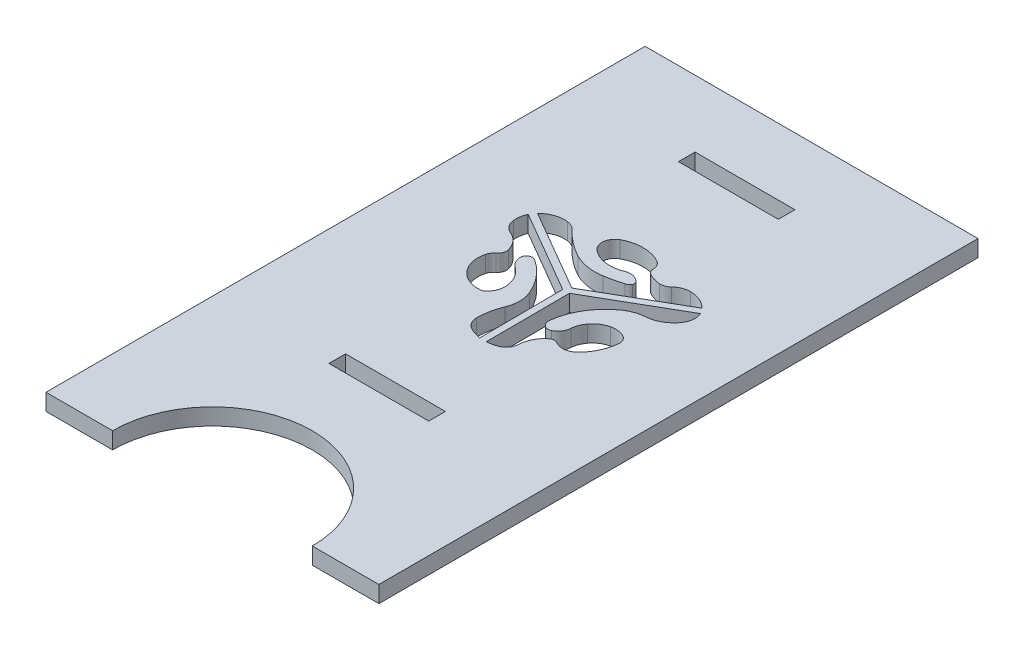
ISO-10303-21;
HEADER;
FILE_DESCRIPTION(('STEP AP214'),'2;1');
FILE_NAME('part.step','',(''),(''),'','','');
FILE_SCHEMA(('AUTOMOTIVE_DESIGN { 1 0 10303 214 1 1 1 1 }'));
ENDSEC;
DATA;
#1=APPLICATION_CONTEXT('core data for automotive mechanical design processes');
#2=APPLICATION_PROTOCOL_DEFINITION('international standard','automotive_design',2000,#1);
#3=PRODUCT_CONTEXT('',#1,'mechanical');
#4=PRODUCT('Part','Part','',(#3));
#5=PRODUCT_RELATED_PRODUCT_CATEGORY('part','',(#4));
#6=PRODUCT_DEFINITION_FORMATION('','',#4);
#7=PRODUCT_DEFINITION_CONTEXT('part definition',#1,'design');
#8=PRODUCT_DEFINITION('design','',#6,#7);
#9=PRODUCT_DEFINITION_SHAPE('','',#8);
#10=(LENGTH_UNIT() NAMED_UNIT(*) SI_UNIT(.MILLI.,.METRE.));
#11=(NAMED_UNIT(*) PLANE_ANGLE_UNIT() SI_UNIT($,.RADIAN.));
#12=(NAMED_UNIT(*) SI_UNIT($,.STERADIAN.) SOLID_ANGLE_UNIT());
#13=UNCERTAINTY_MEASURE_WITH_UNIT(LENGTH_MEASURE(1.E-05),#10,'distance_accuracy_value','');
#14=(GEOMETRIC_REPRESENTATION_CONTEXT(3) GLOBAL_UNCERTAINTY_ASSIGNED_CONTEXT((#13)) GLOBAL_UNIT_ASSIGNED_CONTEXT((#10,
#11,#12)) REPRESENTATION_CONTEXT('',''));
#15=CARTESIAN_POINT('',(0.,0.,0.));
#16=DIRECTION('',(0.,0.,1.));
#17=DIRECTION('',(1.,0.,0.));
#18=AXIS2_PLACEMENT_3D('',#15,#16,#17);
#19=CARTESIAN_POINT('',(0.,5.,130.90636175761));
#20=DIRECTION('',(0.,0.,-1.));
#21=DIRECTION('',(-1.,0.,0.));
#22=AXIS2_PLACEMENT_3D('',#19,#20,#21);
#23=PLANE('',#22);
#24=DIRECTION('',(1.,0.,0.));
#25=VECTOR('',#24,1.);
#26=CARTESIAN_POINT('',(0.,0.,130.90636175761));
#27=LINE('',#26,#25);
#28=CARTESIAN_POINT('',(285.516384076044,0.,130.90636175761));
#29=VERTEX_POINT('',#28);
#30=CARTESIAN_POINT('',(305.516384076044,0.,130.90636175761));
#31=VERTEX_POINT('',#30);
#32=EDGE_CURVE('E1012',#29,#31,#27,.T.);
#33=ORIENTED_EDGE('',*,*,#32,.T.);
#34=DIRECTION('',(0.,-1.,0.));
#35=VECTOR('',#34,1.);
#36=CARTESIAN_POINT('',(305.516384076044,5.,130.90636175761));
#37=LINE('',#36,#35);
#38=CARTESIAN_POINT('',(305.516384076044,5.,130.90636175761));
#39=VERTEX_POINT('',#38);
#40=EDGE_CURVE('E11',#39,#31,#37,.T.);
#41=ORIENTED_EDGE('',*,*,#40,.F.);
#42=DIRECTION('',(1.,0.,0.));
#43=VECTOR('',#42,1.);
#44=CARTESIAN_POINT('',(0.,5.,130.90636175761));
#45=LINE('',#44,#43);
#46=CARTESIAN_POINT('',(285.516384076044,5.,130.90636175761));
#47=VERTEX_POINT('',#46);
#48=EDGE_CURVE('E976',#47,#39,#45,.T.);
#49=ORIENTED_EDGE('',*,*,#48,.F.);
#50=DIRECTION('',(0.,-1.,0.));
#51=VECTOR('',#50,1.);
#52=CARTESIAN_POINT('',(285.516384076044,5.,130.90636175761));
#53=LINE('',#52,#51);
#54=EDGE_CURVE('E1027',#47,#29,#53,.T.);
#55=ORIENTED_EDGE('',*,*,#54,.T.);
#56=EDGE_LOOP('',(#33,#41,#49,#55));
#57=FACE_BOUND('',#56,.T.);
#58=ADVANCED_FACE('F34',(#57),#23,.F.);
#59=CARTESIAN_POINT('',(335.516384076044,5.,130.90636175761));
#60=DIRECTION('',(0.,-1.,0.));
#61=DIRECTION('',(0.,0.,-1.));
#62=AXIS2_PLACEMENT_3D('',#59,#60,#61);
#63=CYLINDRICAL_SURFACE('',#62,30.);
#64=CARTESIAN_POINT('',(335.516384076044,0.,130.90636175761));
#65=DIRECTION('',(0.,1.,0.));
#66=DIRECTION('',(0.,0.,1.));
#67=AXIS2_PLACEMENT_3D('',#64,#65,#66);
#68=CIRCLE('',#67,30.);
#69=CARTESIAN_POINT('',(365.516384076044,0.,130.90636175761));
#70=VERTEX_POINT('',#69);
#71=EDGE_CURVE('E1015',#31,#70,#68,.F.);
#72=ORIENTED_EDGE('',*,*,#71,.T.);
#73=DIRECTION('',(0.,-1.,0.));
#74=VECTOR('',#73,1.);
#75=CARTESIAN_POINT('',(365.516384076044,5.,130.90636175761));
#76=LINE('',#75,#74);
#77=CARTESIAN_POINT('',(365.516384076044,5.,130.90636175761));
#78=VERTEX_POINT('',#77);
#79=EDGE_CURVE('E43',#78,#70,#76,.T.);
#80=ORIENTED_EDGE('',*,*,#79,.F.);
#81=CARTESIAN_POINT('',(335.516384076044,5.,130.90636175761));
#82=DIRECTION('',(0.,1.,0.));
#83=DIRECTION('',(0.,0.,1.));
#84=AXIS2_PLACEMENT_3D('',#81,#82,#83);
#85=CIRCLE('',#84,30.);
#86=EDGE_CURVE('E979',#39,#78,#85,.F.);
#87=ORIENTED_EDGE('',*,*,#86,.F.);
#88=ORIENTED_EDGE('',*,*,#40,.T.);
#89=EDGE_LOOP('',(#72,#80,#87,#88));
#90=FACE_BOUND('',#89,.T.);
#91=ADVANCED_FACE('F1091',(#90),#63,.F.);
#92=CARTESIAN_POINT('',(0.,5.,130.90636175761));
#93=DIRECTION('',(0.,0.,-1.));
#94=DIRECTION('',(-1.,0.,0.));
#95=AXIS2_PLACEMENT_3D('',#92,#93,#94);
#96=PLANE('',#95);
#97=DIRECTION('',(1.,0.,0.));
#98=VECTOR('',#97,1.);
#99=CARTESIAN_POINT('',(0.,0.,130.90636175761));
#100=LINE('',#99,#98);
#101=CARTESIAN_POINT('',(385.516384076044,0.,130.90636175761));
#102=VERTEX_POINT('',#101);
#103=EDGE_CURVE('E1017',#70,#102,#100,.T.);
#104=ORIENTED_EDGE('',*,*,#103,.T.);
#105=DIRECTION('',(0.,-1.,0.));
#106=VECTOR('',#105,1.);
#107=CARTESIAN_POINT('',(385.516384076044,5.,130.90636175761));
#108=LINE('',#107,#106);
#109=CARTESIAN_POINT('',(385.516384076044,5.,130.90636175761));
#110=VERTEX_POINT('',#109);
#111=EDGE_CURVE('E1034',#110,#102,#108,.T.);
#112=ORIENTED_EDGE('',*,*,#111,.F.);
#113=DIRECTION('',(1.,0.,0.));
#114=VECTOR('',#113,1.);
#115=CARTESIAN_POINT('',(0.,5.,130.90636175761));
#116=LINE('',#115,#114);
#117=EDGE_CURVE('E981',#78,#110,#116,.T.);
#118=ORIENTED_EDGE('',*,*,#117,.F.);
#119=ORIENTED_EDGE('',*,*,#79,.T.);
#120=EDGE_LOOP('',(#104,#112,#118,#119));
#121=FACE_BOUND('',#120,.T.);
#122=ADVANCED_FACE('F1096',(#121),#96,.F.);
#123=CARTESIAN_POINT('',(385.516384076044,5.,0.));
#124=DIRECTION('',(-1.,0.,0.));
#125=DIRECTION('',(0.,0.,1.));
#126=AXIS2_PLACEMENT_3D('',#123,#124,#125);
#127=PLANE('',#126);
#128=DIRECTION('',(0.,0.,-1.));
#129=VECTOR('',#128,1.);
#130=CARTESIAN_POINT('',(385.516384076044,0.,0.));
#131=LINE('',#130,#129);
#132=CARTESIAN_POINT('',(385.516384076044,0.,-49.0936382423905));
#133=VERTEX_POINT('',#132);
#134=EDGE_CURVE('E1019',#102,#133,#131,.T.);
#135=ORIENTED_EDGE('',*,*,#134,.T.);
#136=DIRECTION('',(0.,-1.,0.));
#137=VECTOR('',#136,1.);
#138=CARTESIAN_POINT('',(385.516384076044,5.,-49.0936382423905));
#139=LINE('',#138,#137);
#140=CARTESIAN_POINT('',(385.516384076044,5.,-49.0936382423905));
#141=VERTEX_POINT('',#140);
#142=EDGE_CURVE('E1032',#141,#133,#139,.T.);
#143=ORIENTED_EDGE('',*,*,#142,.F.);
#144=DIRECTION('',(0.,0.,-1.));
#145=VECTOR('',#144,1.);
#146=CARTESIAN_POINT('',(385.516384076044,5.,0.));
#147=LINE('',#146,#145);
#148=EDGE_CURVE('E983',#110,#141,#147,.T.);
#149=ORIENTED_EDGE('',*,*,#148,.F.);
#150=ORIENTED_EDGE('',*,*,#111,.T.);
#151=EDGE_LOOP('',(#135,#143,#149,#150));
#152=FACE_BOUND('',#151,.T.);
#153=ADVANCED_FACE('F1100',(#152),#127,.F.);
#154=CARTESIAN_POINT('',(0.,5.,-49.0936382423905));
#155=DIRECTION('',(0.,0.,-1.));
#156=DIRECTION('',(-1.,0.,0.));
#157=AXIS2_PLACEMENT_3D('',#154,#155,#156);
#158=PLANE('',#157);
#159=DIRECTION('',(1.,0.,0.));
#160=VECTOR('',#159,1.);
#161=CARTESIAN_POINT('',(0.,0.,-49.0936382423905));
#162=LINE('',#161,#160);
#163=CARTESIAN_POINT('',(285.516384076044,0.,-49.0936382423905));
#164=VERTEX_POINT('',#163);
#165=EDGE_CURVE('E1022',#164,#133,#162,.T.);
#166=ORIENTED_EDGE('',*,*,#165,.F.);
#167=DIRECTION('',(0.,-1.,0.));
#168=VECTOR('',#167,1.);
#169=CARTESIAN_POINT('',(285.516384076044,5.,-49.0936382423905));
#170=LINE('',#169,#168);
#171=CARTESIAN_POINT('',(285.516384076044,5.,-49.0936382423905));
#172=VERTEX_POINT('',#171);
#173=EDGE_CURVE('E1029',#172,#164,#170,.T.);
#174=ORIENTED_EDGE('',*,*,#173,.F.);
#175=DIRECTION('',(1.,0.,0.));
#176=VECTOR('',#175,1.);
#177=CARTESIAN_POINT('',(0.,5.,-49.0936382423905));
#178=LINE('',#177,#176);
#179=EDGE_CURVE('E985',#172,#141,#178,.T.);
#180=ORIENTED_EDGE('',*,*,#179,.T.);
#181=ORIENTED_EDGE('',*,*,#142,.T.);
#182=EDGE_LOOP('',(#166,#174,#180,#181));
#183=FACE_BOUND('',#182,.T.);
#184=ADVANCED_FACE('F1104',(#183),#158,.T.);
#185=CARTESIAN_POINT('',(320.516384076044,5.,0.));
#186=DIRECTION('',(1.,0.,0.));
#187=DIRECTION('',(0.,0.,-1.));
#188=AXIS2_PLACEMENT_3D('',#185,#186,#187);
#189=PLANE('',#188);
#190=DIRECTION('',(0.,0.,1.));
#191=VECTOR('',#190,1.);
#192=CARTESIAN_POINT('',(320.516384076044,0.,0.));
#193=LINE('',#192,#191);
#194=CARTESIAN_POINT('',(320.516384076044,0.,75.9063617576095));
#195=VERTEX_POINT('',#194);
#196=CARTESIAN_POINT('',(320.516384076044,0.,80.9063617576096));
#197=VERTEX_POINT('',#196);
#198=EDGE_CURVE('E1000',#195,#197,#193,.T.);
#199=ORIENTED_EDGE('',*,*,#198,.F.);
#200=DIRECTION('',(0.,-1.,0.));
#201=VECTOR('',#200,1.);
#202=CARTESIAN_POINT('',(320.516384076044,5.,75.9063617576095));
#203=LINE('',#202,#201);
#204=CARTESIAN_POINT('',(320.516384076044,5.,75.9063617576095));
#205=VERTEX_POINT('',#204);
#206=EDGE_CURVE('E1030',#205,#195,#203,.T.);
#207=ORIENTED_EDGE('',*,*,#206,.F.);
#208=DIRECTION('',(0.,0.,1.));
#209=VECTOR('',#208,1.);
#210=CARTESIAN_POINT('',(320.516384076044,5.,0.));
#211=LINE('',#210,#209);
#212=CARTESIAN_POINT('',(320.516384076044,5.,80.9063617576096));
#213=VERTEX_POINT('',#212);
#214=EDGE_CURVE('E964',#205,#213,#211,.T.);
#215=ORIENTED_EDGE('',*,*,#214,.T.);
#216=DIRECTION('',(0.,-1.,0.));
#217=VECTOR('',#216,1.);
#218=CARTESIAN_POINT('',(320.516384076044,5.,80.9063617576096));
#219=LINE('',#218,#217);
#220=EDGE_CURVE('E1039',#213,#197,#219,.T.);
#221=ORIENTED_EDGE('',*,*,#220,.T.);
#222=EDGE_LOOP('',(#199,#207,#215,#221));
#223=FACE_BOUND('',#222,.T.);
#224=ADVANCED_FACE('F1137',(#223),#189,.T.);
#225=CARTESIAN_POINT('',(0.,5.,75.9063617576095));
#226=DIRECTION('',(0.,0.,1.));
#227=DIRECTION('',(1.,0.,0.));
#228=AXIS2_PLACEMENT_3D('',#225,#226,#227);
#229=PLANE('',#228);
#230=DIRECTION('',(-1.,0.,0.));
#231=VECTOR('',#230,1.);
#232=CARTESIAN_POINT('',(0.,0.,75.9063617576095));
#233=LINE('',#232,#231);
#234=CARTESIAN_POINT('',(350.516384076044,0.,75.9063617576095));
#235=VERTEX_POINT('',#234);
#236=EDGE_CURVE('E1003',#235,#195,#233,.T.);
#237=ORIENTED_EDGE('',*,*,#236,.F.);
#238=DIRECTION('',(0.,-1.,0.));
#239=VECTOR('',#238,1.);
#240=CARTESIAN_POINT('',(350.516384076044,5.,75.9063617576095));
#241=LINE('',#240,#239);
#242=CARTESIAN_POINT('',(350.516384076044,5.,75.9063617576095));
#243=VERTEX_POINT('',#242);
#244=EDGE_CURVE('E1043',#243,#235,#241,.T.);
#245=ORIENTED_EDGE('',*,*,#244,.F.);
#246=DIRECTION('',(-1.,0.,0.));
#247=VECTOR('',#246,1.);
#248=CARTESIAN_POINT('',(0.,5.,75.9063617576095));
#249=LINE('',#248,#247);
#250=EDGE_CURVE('E967',#243,#205,#249,.T.);
#251=ORIENTED_EDGE('',*,*,#250,.T.);
#252=ORIENTED_EDGE('',*,*,#206,.T.);
#253=EDGE_LOOP('',(#237,#245,#251,#252));
#254=FACE_BOUND('',#253,.T.);
#255=ADVANCED_FACE('F1133',(#254),#229,.T.);
#256=CARTESIAN_POINT('',(350.516384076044,5.,0.));
#257=DIRECTION('',(-1.,0.,0.));
#258=DIRECTION('',(0.,0.,1.));
#259=AXIS2_PLACEMENT_3D('',#256,#257,#258);
#260=PLANE('',#259);
#261=DIRECTION('',(0.,0.,-1.));
#262=VECTOR('',#261,1.);
#263=CARTESIAN_POINT('',(350.516384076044,0.,0.));
#264=LINE('',#263,#262);
#265=CARTESIAN_POINT('',(350.516384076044,0.,80.9063617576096));
#266=VERTEX_POINT('',#265);
#267=EDGE_CURVE('E1006',#266,#235,#264,.T.);
#268=ORIENTED_EDGE('',*,*,#267,.F.);
#269=DIRECTION('',(0.,-1.,0.));
#270=VECTOR('',#269,1.);
#271=CARTESIAN_POINT('',(350.516384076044,5.,80.9063617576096));
#272=LINE('',#271,#270);
#273=CARTESIAN_POINT('',(350.516384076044,5.,80.9063617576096));
#274=VERTEX_POINT('',#273);
#275=EDGE_CURVE('E1041',#274,#266,#272,.T.);
#276=ORIENTED_EDGE('',*,*,#275,.F.);
#277=DIRECTION('',(0.,0.,-1.));
#278=VECTOR('',#277,1.);
#279=CARTESIAN_POINT('',(350.516384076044,5.,0.));
#280=LINE('',#279,#278);
#281=EDGE_CURVE('E970',#274,#243,#280,.T.);
#282=ORIENTED_EDGE('',*,*,#281,.T.);
#283=ORIENTED_EDGE('',*,*,#244,.T.);
#284=EDGE_LOOP('',(#268,#276,#282,#283));
#285=FACE_BOUND('',#284,.T.);
#286=ADVANCED_FACE('F1130',(#285),#260,.T.);
#287=CARTESIAN_POINT('',(320.516384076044,5.,0.));
#288=DIRECTION('',(-1.,0.,0.));
#289=DIRECTION('',(0.,0.,1.));
#290=AXIS2_PLACEMENT_3D('',#287,#288,#289);
#291=PLANE('',#290);
#292=DIRECTION('',(0.,0.,-1.));
#293=VECTOR('',#292,1.);
#294=CARTESIAN_POINT('',(320.516384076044,0.,0.));
#295=LINE('',#294,#293);
#296=CARTESIAN_POINT('',(320.516384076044,0.,-24.0936382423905));
#297=VERTEX_POINT('',#296);
#298=CARTESIAN_POINT('',(320.516384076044,0.,-29.0936382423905));
#299=VERTEX_POINT('',#298);
#300=EDGE_CURVE('E915',#297,#299,#295,.T.);
#301=ORIENTED_EDGE('',*,*,#300,.T.);
#302=DIRECTION('',(0.,-1.,0.));
#303=VECTOR('',#302,1.);
#304=CARTESIAN_POINT('',(320.516384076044,5.,-29.0936382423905));
#305=LINE('',#304,#303);
#306=CARTESIAN_POINT('',(320.516384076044,5.,-29.0936382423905));
#307=VERTEX_POINT('',#306);
#308=EDGE_CURVE('E38',#307,#299,#305,.T.);
#309=ORIENTED_EDGE('',*,*,#308,.F.);
#310=DIRECTION('',(0.,0.,-1.));
#311=VECTOR('',#310,1.);
#312=CARTESIAN_POINT('',(320.516384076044,5.,0.));
#313=LINE('',#312,#311);
#314=CARTESIAN_POINT('',(320.516384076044,5.,-24.0936382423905));
#315=VERTEX_POINT('',#314);
#316=EDGE_CURVE('E954',#315,#307,#313,.T.);
#317=ORIENTED_EDGE('',*,*,#316,.F.);
#318=DIRECTION('',(0.,-1.,0.));
#319=VECTOR('',#318,1.);
#320=CARTESIAN_POINT('',(320.516384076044,5.,-24.0936382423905));
#321=LINE('',#320,#319);
#322=EDGE_CURVE('E991',#315,#297,#321,.T.);
#323=ORIENTED_EDGE('',*,*,#322,.T.);
#324=EDGE_LOOP('',(#301,#309,#317,#323));
#325=FACE_BOUND('',#324,.T.);
#326=ADVANCED_FACE('F36',(#325),#291,.F.);
#327=CARTESIAN_POINT('',(0.,5.,-29.0936382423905));
#328=DIRECTION('',(0.,0.,-1.));
#329=DIRECTION('',(-1.,0.,0.));
#330=AXIS2_PLACEMENT_3D('',#327,#328,#329);
#331=PLANE('',#330);
#332=DIRECTION('',(1.,0.,0.));
#333=VECTOR('',#332,1.);
#334=CARTESIAN_POINT('',(0.,0.,-29.0936382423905));
#335=LINE('',#334,#333);
#336=CARTESIAN_POINT('',(350.516384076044,0.,-29.0936382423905));
#337=VERTEX_POINT('',#336);
#338=EDGE_CURVE('E994',#299,#337,#335,.T.);
#339=ORIENTED_EDGE('',*,*,#338,.T.);
#340=DIRECTION('',(0.,-1.,0.));
#341=VECTOR('',#340,1.);
#342=CARTESIAN_POINT('',(350.516384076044,5.,-29.0936382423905));
#343=LINE('',#342,#341);
#344=CARTESIAN_POINT('',(350.516384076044,5.,-29.0936382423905));
#345=VERTEX_POINT('',#344);
#346=EDGE_CURVE('E1050',#345,#337,#343,.T.);
#347=ORIENTED_EDGE('',*,*,#346,.F.);
#348=DIRECTION('',(1.,0.,0.));
#349=VECTOR('',#348,1.);
#350=CARTESIAN_POINT('',(0.,5.,-29.0936382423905));
#351=LINE('',#350,#349);
#352=EDGE_CURVE('E957',#307,#345,#351,.T.);
#353=ORIENTED_EDGE('',*,*,#352,.F.);
#354=ORIENTED_EDGE('',*,*,#308,.T.);
#355=EDGE_LOOP('',(#339,#347,#353,#354));
#356=FACE_BOUND('',#355,.T.);
#357=ADVANCED_FACE('F1059',(#356),#331,.F.);
#358=CARTESIAN_POINT('',(350.516384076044,5.,0.));
#359=DIRECTION('',(1.,0.,0.));
#360=DIRECTION('',(0.,0.,-1.));
#361=AXIS2_PLACEMENT_3D('',#358,#359,#360);
#362=PLANE('',#361);
#363=DIRECTION('',(0.,0.,1.));
#364=VECTOR('',#363,1.);
#365=CARTESIAN_POINT('',(350.516384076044,0.,0.));
#366=LINE('',#365,#364);
#367=CARTESIAN_POINT('',(350.516384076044,0.,-24.0936382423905));
#368=VERTEX_POINT('',#367);
#369=EDGE_CURVE('E996',#337,#368,#366,.T.);
#370=ORIENTED_EDGE('',*,*,#369,.T.);
#371=DIRECTION('',(0.,-1.,0.));
#372=VECTOR('',#371,1.);
#373=CARTESIAN_POINT('',(350.516384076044,5.,-24.0936382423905));
#374=LINE('',#373,#372);
#375=CARTESIAN_POINT('',(350.516384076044,5.,-24.0936382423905));
#376=VERTEX_POINT('',#375);
#377=EDGE_CURVE('E1048',#376,#368,#374,.T.);
#378=ORIENTED_EDGE('',*,*,#377,.F.);
#379=DIRECTION('',(0.,0.,1.));
#380=VECTOR('',#379,1.);
#381=CARTESIAN_POINT('',(350.516384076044,5.,0.));
#382=LINE('',#381,#380);
#383=EDGE_CURVE('E960',#345,#376,#382,.T.);
#384=ORIENTED_EDGE('',*,*,#383,.F.);
#385=ORIENTED_EDGE('',*,*,#346,.T.);
#386=EDGE_LOOP('',(#370,#378,#384,#385));
#387=FACE_BOUND('',#386,.T.);
#388=ADVANCED_FACE('F1068',(#387),#362,.F.);
#389=CARTESIAN_POINT('',(0.,5.,80.9063617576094));
#390=DIRECTION('',(0.,0.,-1.));
#391=DIRECTION('',(-1.,0.,0.));
#392=AXIS2_PLACEMENT_3D('',#389,#390,#391);
#393=PLANE('',#392);
#394=DIRECTION('',(1.,0.,0.));
#395=VECTOR('',#394,1.);
#396=CARTESIAN_POINT('',(0.,0.,80.9063617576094));
#397=LINE('',#396,#395);
#398=EDGE_CURVE('E1009',#197,#266,#397,.T.);
#399=ORIENTED_EDGE('',*,*,#398,.F.);
#400=ORIENTED_EDGE('',*,*,#220,.F.);
#401=DIRECTION('',(1.,0.,0.));
#402=VECTOR('',#401,1.);
#403=CARTESIAN_POINT('',(0.,5.,80.9063617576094));
#404=LINE('',#403,#402);
#405=EDGE_CURVE('E973',#213,#274,#404,.T.);
#406=ORIENTED_EDGE('',*,*,#405,.T.);
#407=ORIENTED_EDGE('',*,*,#275,.T.);
#408=EDGE_LOOP('',(#399,#400,#406,#407));
#409=FACE_BOUND('',#408,.T.);
#410=ADVANCED_FACE('F1126',(#409),#393,.T.);
#411=CARTESIAN_POINT('',(0.,5.,-24.0936382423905));
#412=DIRECTION('',(0.,0.,1.));
#413=DIRECTION('',(1.,0.,0.));
#414=AXIS2_PLACEMENT_3D('',#411,#412,#413);
#415=PLANE('',#414);
#416=DIRECTION('',(-1.,0.,0.));
#417=VECTOR('',#416,1.);
#418=CARTESIAN_POINT('',(0.,0.,-24.0936382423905));
#419=LINE('',#418,#417);
#420=EDGE_CURVE('E998',#368,#297,#419,.T.);
#421=ORIENTED_EDGE('',*,*,#420,.T.);
#422=ORIENTED_EDGE('',*,*,#322,.F.);
#423=DIRECTION('',(-1.,0.,0.));
#424=VECTOR('',#423,1.);
#425=CARTESIAN_POINT('',(0.,5.,-24.0936382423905));
#426=LINE('',#425,#424);
#427=EDGE_CURVE('E962',#376,#315,#426,.T.);
#428=ORIENTED_EDGE('',*,*,#427,.F.);
#429=ORIENTED_EDGE('',*,*,#377,.T.);
#430=EDGE_LOOP('',(#421,#422,#428,#429));
#431=FACE_BOUND('',#430,.T.);
#432=ADVANCED_FACE('F1071',(#431),#415,.F.);
#433=CARTESIAN_POINT('',(285.516384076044,5.,0.));
#434=DIRECTION('',(-1.,0.,0.));
#435=DIRECTION('',(0.,0.,1.));
#436=AXIS2_PLACEMENT_3D('',#433,#434,#435);
#437=PLANE('',#436);
#438=DIRECTION('',(0.,0.,-1.));
#439=VECTOR('',#438,1.);
#440=CARTESIAN_POINT('',(285.516384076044,0.,0.));
#441=LINE('',#440,#439);
#442=EDGE_CURVE('E958',#29,#164,#441,.T.);
#443=ORIENTED_EDGE('',*,*,#442,.F.);
#444=ORIENTED_EDGE('',*,*,#54,.F.);
#445=DIRECTION('',(0.,0.,-1.));
#446=VECTOR('',#445,1.);
#447=CARTESIAN_POINT('',(285.516384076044,5.,0.));
#448=LINE('',#447,#446);
#449=EDGE_CURVE('E988',#47,#172,#448,.T.);
#450=ORIENTED_EDGE('',*,*,#449,.T.);
#451=ORIENTED_EDGE('',*,*,#173,.T.);
#452=EDGE_LOOP('',(#443,#444,#450,#451));
#453=FACE_BOUND('',#452,.T.);
#454=ADVANCED_FACE('F1076',(#453),#437,.T.);
#455=CARTESIAN_POINT('',(0.,5.,0.));
#456=DIRECTION('',(0.,1.,0.));
#457=DIRECTION('',(0.,0.,1.));
#458=AXIS2_PLACEMENT_3D('',#455,#456,#457);
#459=PLANE('',#458);
#460=CARTESIAN_POINT('',(337.789541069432,5.,41.5011160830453));
#461=DIRECTION('',(0.,1.,0.));
#462=DIRECTION('',(0.,0.,-1.));
#463=AXIS2_PLACEMENT_3D('',#460,#461,#462);
#464=CIRCLE('',#463,10.1555127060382);
#465=CARTESIAN_POINT('',(333.009513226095,5.,50.4613489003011));
#466=VERTEX_POINT('',#465);
#467=CARTESIAN_POINT('',(336.512961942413,5.,51.5760743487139));
#468=VERTEX_POINT('',#467);
#469=EDGE_CURVE('E51',#466,#468,#464,.T.);
#470=ORIENTED_EDGE('',*,*,#469,.F.);
#471=CARTESIAN_POINT('',(334.952661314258,5.,46.8188890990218));
#472=DIRECTION('',(0.,1.,0.));
#473=DIRECTION('',(0.,0.,-1.));
#474=AXIS2_PLACEMENT_3D('',#471,#472,#473);
#475=CIRCLE('',#474,4.12835777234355);
#476=CARTESIAN_POINT('',(330.824303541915,5.,46.8188890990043));
#477=VERTEX_POINT('',#476);
#478=EDGE_CURVE('E504',#477,#466,#475,.T.);
#479=ORIENTED_EDGE('',*,*,#478,.F.);
#480=CARTESIAN_POINT('',(349.353345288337,5.,46.8188890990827));
#481=DIRECTION('',(0.,1.,0.));
#482=DIRECTION('',(0.,0.,-1.));
#483=AXIS2_PLACEMENT_3D('',#480,#481,#482);
#484=CIRCLE('',#483,18.5290417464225);
#485=CARTESIAN_POINT('',(332.240217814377,5.,39.7149285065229));
#486=VERTEX_POINT('',#485);
#487=EDGE_CURVE('E507',#486,#477,#484,.T.);
#488=ORIENTED_EDGE('',*,*,#487,.F.);
#489=CARTESIAN_POINT('',(323.426011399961,5.,36.0559961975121));
#490=DIRECTION('',(0.,-1.,0.));
#491=DIRECTION('',(0.,0.,1.));
#492=AXIS2_PLACEMENT_3D('',#489,#490,#491);
#493=CIRCLE('',#492,9.54348051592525);
#494=CARTESIAN_POINT('',(332.240217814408,5.,32.397063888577));
#495=VERTEX_POINT('',#494);
#496=EDGE_CURVE('E601',#495,#486,#493,.T.);
#497=ORIENTED_EDGE('',*,*,#496,.F.);
#498=CARTESIAN_POINT('',(313.285096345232,5.,40.2656686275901));
#499=DIRECTION('',(0.,-1.,0.));
#500=DIRECTION('',(0.,0.,1.));
#501=AXIS2_PLACEMENT_3D('',#498,#499,#500);
#502=CIRCLE('',#501,20.5234395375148);
#503=CARTESIAN_POINT('',(324.40530980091,5.,23.0159607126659));
#504=VERTEX_POINT('',#503);
#505=EDGE_CURVE('E598',#504,#495,#502,.T.);
#506=ORIENTED_EDGE('',*,*,#505,.F.);
#507=CARTESIAN_POINT('',(323.443489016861,5.,24.5079399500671));
#508=DIRECTION('',(0.,-1.,0.));
#509=DIRECTION('',(0.,0.,1.));
#510=AXIS2_PLACEMENT_3D('',#507,#508,#509);
#511=CIRCLE('',#510,1.77513415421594);
#512=CARTESIAN_POINT('',(321.668354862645,5.,24.5079399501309));
#513=VERTEX_POINT('',#512);
#514=EDGE_CURVE('E595',#513,#504,#511,.T.);
#515=ORIENTED_EDGE('',*,*,#514,.F.);
#516=CARTESIAN_POINT('',(325.72192658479,5.,24.5079399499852));
#517=DIRECTION('',(0.,-1.,0.));
#518=DIRECTION('',(0.,0.,1.));
#519=AXIS2_PLACEMENT_3D('',#516,#517,#518);
#520=CIRCLE('',#519,4.05357172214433);
#521=CARTESIAN_POINT('',(323.399603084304,5.,27.8303272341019));
#522=VERTEX_POINT('',#521);
#523=EDGE_CURVE('E592',#522,#513,#520,.T.);
#524=ORIENTED_EDGE('',*,*,#523,.F.);
#525=CARTESIAN_POINT('',(318.523742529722,5.,34.8058830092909));
#526=DIRECTION('',(0.,1.,0.));
#527=DIRECTION('',(0.,0.,-1.));
#528=AXIS2_PLACEMENT_3D('',#525,#526,#527);
#529=CIRCLE('',#528,8.51072232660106);
#530=CARTESIAN_POINT('',(327.000125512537,5.,34.0421251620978));
#531=VERTEX_POINT('',#530);
#532=EDGE_CURVE('E589',#531,#522,#529,.T.);
#533=ORIENTED_EDGE('',*,*,#532,.F.);
#534=CARTESIAN_POINT('',(321.680445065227,5.,34.5214508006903));
#535=DIRECTION('',(0.,1.,0.));
#536=DIRECTION('',(0.,0.,-1.));
#537=AXIS2_PLACEMENT_3D('',#534,#535,#536);
#538=CIRCLE('',#537,5.34123142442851);
#539=CARTESIAN_POINT('',(326.09277439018,5.,37.5314513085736));
#540=VERTEX_POINT('',#539);
#541=EDGE_CURVE('E586',#540,#531,#538,.T.);
#542=ORIENTED_EDGE('',*,*,#541,.F.);
#543=CARTESIAN_POINT('',(316.671641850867,5.,31.104548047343));
#544=DIRECTION('',(0.,1.,0.));
#545=DIRECTION('',(0.,0.,-1.));
#546=AXIS2_PLACEMENT_3D('',#543,#544,#545);
#547=CIRCLE('',#546,11.4045089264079);
#548=CARTESIAN_POINT('',(325.531792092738,5.,38.2851163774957));
#549=VERTEX_POINT('',#548);
#550=EDGE_CURVE('E583',#549,#540,#547,.T.);
#551=ORIENTED_EDGE('',*,*,#550,.F.);
#552=CARTESIAN_POINT('',(324.010165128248,5.,37.0519379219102));
#553=DIRECTION('',(0.,1.,0.));
#554=DIRECTION('',(0.,0.,-1.));
#555=AXIS2_PLACEMENT_3D('',#552,#553,#554);
#556=CIRCLE('',#555,1.95859074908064);
#557=CARTESIAN_POINT('',(324.213895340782,5.,38.9999039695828));
#558=VERTEX_POINT('',#557);
#559=EDGE_CURVE('E580',#558,#549,#556,.T.);
#560=ORIENTED_EDGE('',*,*,#559,.F.);
#561=CARTESIAN_POINT('',(323.38218800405,5.,31.0475358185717));
#562=DIRECTION('',(0.,1.,0.));
#563=DIRECTION('',(0.,0.,-1.));
#564=AXIS2_PLACEMENT_3D('',#561,#562,#563);
#565=CIRCLE('',#564,7.99574238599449);
#566=CARTESIAN_POINT('',(315.637577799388,5.,29.0593434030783));
#567=VERTEX_POINT('',#566);
#568=EDGE_CURVE('E577',#567,#558,#565,.T.);
#569=ORIENTED_EDGE('',*,*,#568,.F.);
#570=CARTESIAN_POINT('',(319.13291211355,5.,29.9566638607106));
#571=DIRECTION('',(0.,1.,0.));
#572=DIRECTION('',(0.,0.,-1.));
#573=AXIS2_PLACEMENT_3D('',#570,#571,#572);
#574=CIRCLE('',#573,3.60867648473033);
#575=CARTESIAN_POINT('',(316.953194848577,5.,27.0806634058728));
#576=VERTEX_POINT('',#575);
#577=EDGE_CURVE('E574',#576,#567,#574,.T.);
#578=ORIENTED_EDGE('',*,*,#577,.F.);
#579=CARTESIAN_POINT('',(315.389135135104,5.,25.0169845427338));
#580=DIRECTION('',(0.,-1.,0.));
#581=DIRECTION('',(0.,0.,1.));
#582=AXIS2_PLACEMENT_3D('',#579,#580,#581);
#583=CIRCLE('',#582,2.58941175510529);
#584=CARTESIAN_POINT('',(317.891839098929,5.,24.3525102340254));
#585=VERTEX_POINT('',#584);
#586=EDGE_CURVE('E571',#585,#576,#583,.T.);
#587=ORIENTED_EDGE('',*,*,#586,.F.);
#588=CARTESIAN_POINT('',(311.036174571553,5.,26.172706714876));
#589=DIRECTION('',(0.,-1.,0.));
#590=DIRECTION('',(0.,0.,1.));
#591=AXIS2_PLACEMENT_3D('',#588,#589,#590);
#592=CIRCLE('',#591,7.09318344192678);
#593=CARTESIAN_POINT('',(313.756212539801,5.,19.621779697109));
#594=VERTEX_POINT('',#593);
#595=EDGE_CURVE('E568',#594,#585,#592,.T.);
#596=ORIENTED_EDGE('',*,*,#595,.F.);
#597=CARTESIAN_POINT('',(315.462427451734,5.,15.5125394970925));
#598=DIRECTION('',(0.,1.,0.));
#599=DIRECTION('',(0.,0.,-1.));
#600=AXIS2_PLACEMENT_3D('',#597,#598,#599);
#601=CIRCLE('',#600,4.44938471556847);
#602=CARTESIAN_POINT('',(311.036174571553,5.,15.965650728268));
#603=VERTEX_POINT('',#602);
#604=EDGE_CURVE('E565',#603,#594,#601,.T.);
#605=ORIENTED_EDGE('',*,*,#604,.F.);
#606=CARTESIAN_POINT('',(318.547587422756,5.,15.1967146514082));
#607=DIRECTION('',(0.,1.,0.));
#608=DIRECTION('',(0.,0.,-1.));
#609=AXIS2_PLACEMENT_3D('',#606,#607,#608);
#610=CIRCLE('',#609,7.55066789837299);
#611=CARTESIAN_POINT('',(311.633322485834,5.,12.1626536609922));
#612=VERTEX_POINT('',#611);
#613=EDGE_CURVE('E562',#612,#603,#610,.T.);
#614=ORIENTED_EDGE('',*,*,#613,.F.);
#615=DIRECTION('',(-0.864744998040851,0.,-0.502211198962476));
#616=VECTOR('',#615,1.);
#617=CARTESIAN_POINT('',(311.633322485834,5.,12.1626536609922));
#618=LINE('',#617,#616);
#619=CARTESIAN_POINT('',(336.379986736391,5.,26.5345805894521));
#620=VERTEX_POINT('',#619);
#621=EDGE_CURVE('E559',#620,#612,#618,.T.);
#622=ORIENTED_EDGE('',*,*,#621,.F.);
#623=DIRECTION('',(-0.00531011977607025,0.,-0.999985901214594));
#624=VECTOR('',#623,1.);
#625=CARTESIAN_POINT('',(336.379986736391,5.,26.5345805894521));
#626=LINE('',#625,#624);
#627=EDGE_CURVE('E557',#468,#620,#626,.T.);
#628=ORIENTED_EDGE('',*,*,#627,.F.);
#629=EDGE_LOOP('',(#470,#479,#488,#497,#506,#515,#524,#533,#542,#551,#560,#569,#578,#587,#596,
#605,#614,#622,#628));
#630=FACE_BOUND('',#629,.T.);
#631=CARTESIAN_POINT('',(355.272534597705,5.,12.0429654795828));
#632=DIRECTION('',(0.,1.,0.));
#633=DIRECTION('',(0.,0.,-1.));
#634=AXIS2_PLACEMENT_3D('',#631,#632,#633);
#635=CIRCLE('',#634,9.19861851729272);
#636=CARTESIAN_POINT('',(355.893171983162,5.,21.2206226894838));
#637=VERTEX_POINT('',#636);
#638=CARTESIAN_POINT('',(363.048217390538,5.,16.957570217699));
#639=VERTEX_POINT('',#638);
#640=EDGE_CURVE('E608',#637,#639,#635,.T.);
#641=ORIENTED_EDGE('',*,*,#640,.F.);
#642=CARTESIAN_POINT('',(356.598660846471,5.,31.6530186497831));
#643=DIRECTION('',(0.,-1.,0.));
#644=DIRECTION('',(0.,0.,1.));
#645=AXIS2_PLACEMENT_3D('',#642,#643,#644);
#646=CIRCLE('',#645,10.4562230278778);
#647=CARTESIAN_POINT('',(350.705119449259,5.,23.0159607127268));
#648=VERTEX_POINT('',#647);
#649=EDGE_CURVE('E646',#648,#637,#646,.T.);
#650=ORIENTED_EDGE('',*,*,#649,.F.);
#651=CARTESIAN_POINT('',(361.557805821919,5.,38.9207070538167));
#652=DIRECTION('',(0.,-1.,0.));
#653=DIRECTION('',(0.,0.,1.));
#654=AXIS2_PLACEMENT_3D('',#651,#652,#653);
#655=CIRCLE('',#654,19.2546554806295);
#656=CARTESIAN_POINT('',(342.449120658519,5.,36.5542943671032));
#657=VERTEX_POINT('',#656);
#658=EDGE_CURVE('E750',#657,#648,#655,.T.);
#659=ORIENTED_EDGE('',*,*,#658,.F.);
#660=CARTESIAN_POINT('',(344.768622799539,5.,36.8415406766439));
#661=DIRECTION('',(0.,-1.,0.));
#662=DIRECTION('',(0.,0.,1.));
#663=AXIS2_PLACEMENT_3D('',#660,#661,#662);
#664=CIRCLE('',#663,2.33722070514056);
#665=CARTESIAN_POINT('',(343.701070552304,5.,38.9207070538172));
#666=VERTEX_POINT('',#665);
#667=EDGE_CURVE('E747',#666,#657,#664,.T.);
#668=ORIENTED_EDGE('',*,*,#667,.F.);
#669=CARTESIAN_POINT('',(344.560786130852,5.,37.2463236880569));
#670=DIRECTION('',(0.,-1.,0.));
#671=DIRECTION('',(0.,0.,1.));
#672=AXIS2_PLACEMENT_3D('',#669,#670,#671);
#673=CIRCLE('',#672,1.88219832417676);
#674=CARTESIAN_POINT('',(345.420501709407,5.,38.9207070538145));
#675=VERTEX_POINT('',#674);
#676=EDGE_CURVE('E744',#675,#666,#673,.T.);
#677=ORIENTED_EDGE('',*,*,#676,.F.);
#678=CARTESIAN_POINT('',(343.470515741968,5.,35.1229114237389));
#679=DIRECTION('',(0.,-1.,0.));
#680=DIRECTION('',(0.,0.,1.));
#681=AXIS2_PLACEMENT_3D('',#678,#679,#680);
#682=CIRCLE('',#681,4.26915646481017);
#683=CARTESIAN_POINT('',(347.727729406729,5.,35.4420175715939));
#684=VERTEX_POINT('',#683);
#685=EDGE_CURVE('E741',#684,#675,#682,.T.);
#686=ORIENTED_EDGE('',*,*,#685,.F.);
#687=CARTESIAN_POINT('',(354.595006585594,5.,35.9567651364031));
#688=DIRECTION('',(0.,1.,0.));
#689=DIRECTION('',(0.,0.,-1.));
#690=AXIS2_PLACEMENT_3D('',#687,#688,#689);
#691=CIRCLE('',#690,6.8865420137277);
#692=CARTESIAN_POINT('',(349.095861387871,5.,31.811422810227));
#693=VERTEX_POINT('',#692);
#694=EDGE_CURVE('E738',#693,#684,#691,.T.);
#695=ORIENTED_EDGE('',*,*,#694,.F.);
#696=CARTESIAN_POINT('',(355.037323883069,5.,36.2901908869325));
#697=DIRECTION('',(0.,1.,0.));
#698=DIRECTION('',(0.,0.,-1.));
#699=AXIS2_PLACEMENT_3D('',#696,#697,#698);
#700=CIRCLE('',#699,7.44045294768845);
#701=CARTESIAN_POINT('',(353.283703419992,5.,29.0593434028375));
#702=VERTEX_POINT('',#701);
#703=EDGE_CURVE('E735',#702,#693,#700,.T.);
#704=ORIENTED_EDGE('',*,*,#703,.F.);
#705=CARTESIAN_POINT('',(354.686600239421,5.,34.8440232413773));
#706=DIRECTION('',(0.,1.,0.));
#707=DIRECTION('',(0.,0.,-1.));
#708=AXIS2_PLACEMENT_3D('',#705,#706,#707);
#709=CIRCLE('',#708,5.95236426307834);
#710=CARTESIAN_POINT('',(357.562269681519,5.,29.6323857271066));
#711=VERTEX_POINT('',#710);
#712=EDGE_CURVE('E732',#711,#702,#709,.T.);
#713=ORIENTED_EDGE('',*,*,#712,.F.);
#714=CARTESIAN_POINT('',(356.310118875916,5.,31.9016855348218));
#715=DIRECTION('',(0.,1.,0.));
#716=DIRECTION('',(0.,0.,-1.));
#717=AXIS2_PLACEMENT_3D('',#714,#715,#716);
#718=CIRCLE('',#717,2.59183395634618);
#719=CARTESIAN_POINT('',(358.894718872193,5.,32.0951955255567));
#720=VERTEX_POINT('',#719);
#721=EDGE_CURVE('E729',#720,#711,#718,.T.);
#722=ORIENTED_EDGE('',*,*,#721,.F.);
#723=CARTESIAN_POINT('',(345.52716371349,5.,31.0943615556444));
#724=DIRECTION('',(0.,1.,0.));
#725=DIRECTION('',(0.,0.,-1.));
#726=AXIS2_PLACEMENT_3D('',#723,#724,#725);
#727=CIRCLE('',#726,13.4049692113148);
#728=CARTESIAN_POINT('',(355.037323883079,5.,40.5415861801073));
#729=VERTEX_POINT('',#728);
#730=EDGE_CURVE('E726',#729,#720,#727,.T.);
#731=ORIENTED_EDGE('',*,*,#730,.F.);
#732=CARTESIAN_POINT('',(351.736128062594,5.,37.2622367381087));
#733=DIRECTION('',(0.,1.,0.));
#734=DIRECTION('',(0.,0.,-1.));
#735=AXIS2_PLACEMENT_3D('',#732,#733,#734);
#736=CIRCLE('',#735,4.65317382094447);
#737=CARTESIAN_POINT('',(349.366838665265,5.,41.2670456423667));
#738=VERTEX_POINT('',#737);
#739=EDGE_CURVE('E723',#738,#729,#736,.T.);
#740=ORIENTED_EDGE('',*,*,#739,.F.);
#741=CARTESIAN_POINT('',(348.376522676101,5.,42.9409763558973));
#742=DIRECTION('',(0.,-1.,0.));
#743=DIRECTION('',(0.,0.,1.));
#744=AXIS2_PLACEMENT_3D('',#741,#742,#743);
#745=CIRCLE('',#744,1.94493439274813);
#746=CARTESIAN_POINT('',(347.179326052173,5.,41.4081717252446));
#747=VERTEX_POINT('',#746);
#748=EDGE_CURVE('E720',#747,#738,#745,.T.);
#749=ORIENTED_EDGE('',*,*,#748,.F.);
#750=CARTESIAN_POINT('',(352.179341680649,5.,47.8098328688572));
#751=DIRECTION('',(0.,-1.,0.));
#752=DIRECTION('',(0.,0.,1.));
#753=AXIS2_PLACEMENT_3D('',#750,#751,#752);
#754=CIRCLE('',#753,8.12289490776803);
#755=CARTESIAN_POINT('',(344.065430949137,5.,47.4278978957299));
#756=VERTEX_POINT('',#755);
#757=EDGE_CURVE('E717',#756,#747,#754,.T.);
#758=ORIENTED_EDGE('',*,*,#757,.F.);
#759=CARTESIAN_POINT('',(340.10338519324,5.,47.2413979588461));
#760=DIRECTION('',(0.,1.,0.));
#761=DIRECTION('',(0.,0.,-1.));
#762=AXIS2_PLACEMENT_3D('',#759,#760,#761);
#763=CIRCLE('',#762,3.96643275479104);
#764=CARTESIAN_POINT('',(341.586272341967,5.,50.9202068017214));
#765=VERTEX_POINT('',#764);
#766=EDGE_CURVE('E714',#765,#756,#763,.T.);
#767=ORIENTED_EDGE('',*,*,#766,.F.);
#768=CARTESIAN_POINT('',(337.789541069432,5.,41.5011160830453));
#769=DIRECTION('',(0.,1.,0.));
#770=DIRECTION('',(0.,0.,-1.));
#771=AXIS2_PLACEMENT_3D('',#768,#769,#770);
#772=CIRCLE('',#771,10.1555127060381);
#773=CARTESIAN_POINT('',(338.513280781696,5.,51.6308070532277));
#774=VERTEX_POINT('',#773);
#775=EDGE_CURVE('E711',#774,#765,#772,.T.);
#776=ORIENTED_EDGE('',*,*,#775,.F.);
#777=DIRECTION('',(0.00531011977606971,0.,0.999985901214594));
#778=VECTOR('',#777,1.);
#779=CARTESIAN_POINT('',(338.380006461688,5.,26.5329850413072));
#780=LINE('',#779,#778);
#781=CARTESIAN_POINT('',(338.380006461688,5.,26.5329850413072));
#782=VERTEX_POINT('',#781);
#783=EDGE_CURVE('E708',#782,#774,#780,.T.);
#784=ORIENTED_EDGE('',*,*,#783,.F.);
#785=DIRECTION('',(-0.866210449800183,0.,0.499679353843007));
#786=VECTOR('',#785,1.);
#787=CARTESIAN_POINT('',(338.380006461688,5.,26.5329850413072));
#788=LINE('',#787,#786);
#789=CARTESIAN_POINT('',(363.344461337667,5.,12.132070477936));
#790=VERTEX_POINT('',#789);
#791=EDGE_CURVE('E705',#790,#782,#788,.T.);
#792=ORIENTED_EDGE('',*,*,#791,.F.);
#793=CARTESIAN_POINT('',(358.80425862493,5.,14.2751845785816));
#794=DIRECTION('',(0.,1.,0.));
#795=DIRECTION('',(0.,0.,-1.));
#796=AXIS2_PLACEMENT_3D('',#793,#794,#795);
#797=CIRCLE('',#796,5.0205954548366);
#798=EDGE_CURVE('E702',#639,#790,#797,.T.);
#799=ORIENTED_EDGE('',*,*,#798,.F.);
#800=EDGE_LOOP('',(#641,#650,#659,#668,#677,#686,#695,#704,#713,#722,#731,#740,#749,#758,#767,
#776,#784,#792,#799));
#801=FACE_BOUND('',#800,.T.);
#802=CARTESIAN_POINT('',(318.500627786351,5.,15.9656507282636));
#803=DIRECTION('',(0.,1.,0.));
#804=DIRECTION('',(0.,0.,-1.));
#805=AXIS2_PLACEMENT_3D('',#802,#803,#804);
#806=CIRCLE('',#805,7.84618196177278);
#807=CARTESIAN_POINT('',(319.404768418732,5.,8.17173636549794));
#808=VERTEX_POINT('',#807);
#809=CARTESIAN_POINT('',(312.952539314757,5.,10.4175622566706));
#810=VERTEX_POINT('',#809);
#811=EDGE_CURVE('E757',#808,#810,#806,.T.);
#812=ORIENTED_EDGE('',*,*,#811,.F.);
#813=CARTESIAN_POINT('',(318.848980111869,5.,12.9627681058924));
#814=DIRECTION('',(0.,1.,0.));
#815=DIRECTION('',(0.,0.,-1.));
#816=AXIS2_PLACEMENT_3D('',#813,#814,#815);
#817=CIRCLE('',#816,4.82316138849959);
#818=CARTESIAN_POINT('',(322.396722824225,5.,9.69529087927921));
#819=VERTEX_POINT('',#818);
#820=EDGE_CURVE('E798',#819,#808,#817,.T.);
#821=ORIENTED_EDGE('',*,*,#820,.F.);
#822=CARTESIAN_POINT('',(343.107372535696,5.,-9.37925363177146));
#823=DIRECTION('',(0.,-1.,0.));
#824=DIRECTION('',(0.,0.,1.));
#825=AXIS2_PLACEMENT_3D('',#822,#823,#824);
#826=CIRCLE('',#825,28.1561584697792);
#827=CARTESIAN_POINT('',(329.896357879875,5.,15.4851456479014));
#828=VERTEX_POINT('',#827);
#829=EDGE_CURVE('E908',#828,#819,#826,.T.);
#830=ORIENTED_EDGE('',*,*,#829,.F.);
#831=CARTESIAN_POINT('',(336.548701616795,5.,2.96479538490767));
#832=DIRECTION('',(0.,-1.,0.));
#833=DIRECTION('',(0.,0.,1.));
#834=AXIS2_PLACEMENT_3D('',#831,#832,#833);
#835=CIRCLE('',#834,14.1778999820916);
#836=CARTESIAN_POINT('',(338.832361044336,5.,16.957570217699));
#837=VERTEX_POINT('',#836);
#838=EDGE_CURVE('E905',#837,#828,#835,.T.);
#839=ORIENTED_EDGE('',*,*,#838,.F.);
#840=CARTESIAN_POINT('',(331.599607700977,5.,-27.3600227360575));
#841=DIRECTION('',(0.,-1.,0.));
#842=DIRECTION('',(0.,0.,1.));
#843=AXIS2_PLACEMENT_3D('',#840,#841,#842);
#844=CIRCLE('',#843,44.9039170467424);
#845=CARTESIAN_POINT('',(344.301186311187,5.,15.7100558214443));
#846=VERTEX_POINT('',#845);
#847=EDGE_CURVE('E902',#846,#837,#844,.T.);
#848=ORIENTED_EDGE('',*,*,#847,.F.);
#849=CARTESIAN_POINT('',(343.701070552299,5.,13.6751093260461));
#850=DIRECTION('',(0.,-1.,0.));
#851=DIRECTION('',(0.,0.,1.));
#852=AXIS2_PLACEMENT_3D('',#849,#850,#851);
#853=CIRCLE('',#852,2.12159047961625);
#854=CARTESIAN_POINT('',(345.555892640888,5.,14.7050516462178));
#855=VERTEX_POINT('',#854);
#856=EDGE_CURVE('E899',#855,#846,#853,.T.);
#857=ORIENTED_EDGE('',*,*,#856,.F.);
#858=CARTESIAN_POINT('',(344.68853871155,5.,14.2234288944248));
#859=DIRECTION('',(0.,-1.,0.));
#860=DIRECTION('',(0.,0.,1.));
#861=AXIS2_PLACEMENT_3D('',#858,#859,#860);
#862=CIRCLE('',#861,0.992100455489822);
#863=CARTESIAN_POINT('',(345.420501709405,5.,13.55373233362));
#864=VERTEX_POINT('',#863);
#865=EDGE_CURVE('E896',#864,#855,#862,.T.);
#866=ORIENTED_EDGE('',*,*,#865,.F.);
#867=CARTESIAN_POINT('',(342.44912065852,5.,16.2723447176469));
#868=DIRECTION('',(0.,-1.,0.));
#869=DIRECTION('',(0.,0.,1.));
#870=AXIS2_PLACEMENT_3D('',#867,#868,#869);
#871=CIRCLE('',#870,4.02740097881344);
#872=CARTESIAN_POINT('',(340.913612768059,5.,12.5491506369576));
#873=VERTEX_POINT('',#872);
#874=EDGE_CURVE('E893',#873,#864,#871,.T.);
#875=ORIENTED_EDGE('',*,*,#874,.F.);
#876=CARTESIAN_POINT('',(337.258675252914,5.,3.68690915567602));
#877=DIRECTION('',(0.,1.,0.));
#878=DIRECTION('',(0.,0.,-1.));
#879=AXIS2_PLACEMENT_3D('',#876,#877,#878);
#880=CIRCLE('',#879,9.58633883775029);
#881=CARTESIAN_POINT('',(331.599607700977,5.,11.4246637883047));
#882=VERTEX_POINT('',#881);
#883=EDGE_CURVE('E890',#882,#873,#880,.T.);
#884=ORIENTED_EDGE('',*,*,#883,.F.);
#885=CARTESIAN_POINT('',(333.853406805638,5.,8.34299983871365));
#886=DIRECTION('',(0.,1.,0.));
#887=DIRECTION('',(0.,0.,-1.));
#888=AXIS2_PLACEMENT_3D('',#885,#886,#887);
#889=CIRCLE('',#888,3.81788725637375);
#890=CARTESIAN_POINT('',(332.017732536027,5.,4.99537932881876));
#891=VERTEX_POINT('',#890);
#892=EDGE_CURVE('E887',#891,#882,#889,.T.);
#893=ORIENTED_EDGE('',*,*,#892,.F.);
#894=CARTESIAN_POINT('',(337.562552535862,5.,15.1071695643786));
#895=DIRECTION('',(0.,1.,0.));
#896=DIRECTION('',(0.,0.,-1.));
#897=AXIS2_PLACEMENT_3D('',#894,#895,#896);
#898=CIRCLE('',#897,11.5322734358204);
#899=CARTESIAN_POINT('',(343.107372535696,5.,4.99537932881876));
#900=VERTEX_POINT('',#899);
#901=EDGE_CURVE('E884',#900,#891,#898,.T.);
#902=ORIENTED_EDGE('',*,*,#901,.F.);
#903=CARTESIAN_POINT('',(341.643096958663,5.,7.66570000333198));
#904=DIRECTION('',(0.,1.,0.));
#905=DIRECTION('',(0.,0.,-1.));
#906=AXIS2_PLACEMENT_3D('',#903,#904,#905);
#907=CIRCLE('',#906,3.04544175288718);
#908=CARTESIAN_POINT('',(344.68853871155,5.,7.66570000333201));
#909=VERTEX_POINT('',#908);
#910=EDGE_CURVE('E881',#909,#900,#907,.T.);
#911=ORIENTED_EDGE('',*,*,#910,.F.);
#912=CARTESIAN_POINT('',(346.634068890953,5.,7.66570000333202));
#913=DIRECTION('',(0.,-1.,0.));
#914=DIRECTION('',(0.,0.,1.));
#915=AXIS2_PLACEMENT_3D('',#912,#913,#914);
#916=CIRCLE('',#915,1.9455301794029);
#917=CARTESIAN_POINT('',(345.673849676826,5.,9.35775991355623));
#918=VERTEX_POINT('',#917);
#919=EDGE_CURVE('E878',#918,#909,#916,.T.);
#920=ORIENTED_EDGE('',*,*,#919,.F.);
#921=CARTESIAN_POINT('',(350.137508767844,5.,1.49207831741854));
#922=DIRECTION('',(0.,-1.,0.));
#923=DIRECTION('',(0.,0.,1.));
#924=AXIS2_PLACEMENT_3D('',#921,#922,#923);
#925=CIRCLE('',#924,9.04395927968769);
#926=CARTESIAN_POINT('',(349.366838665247,5.,10.503141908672));
#927=VERTEX_POINT('',#926);
#928=EDGE_CURVE('E875',#927,#918,#925,.T.);
#929=ORIENTED_EDGE('',*,*,#928,.F.);
#930=CARTESIAN_POINT('',(349.665324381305,5.,7.01309635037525));
#931=DIRECTION('',(0.,-1.,0.));
#932=DIRECTION('',(0.,0.,1.));
#933=AXIS2_PLACEMENT_3D('',#930,#931,#932);
#934=CIRCLE('',#933,3.50278627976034);
#935=CARTESIAN_POINT('',(352.098517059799,5.,9.53283544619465));
#936=VERTEX_POINT('',#935);
#937=EDGE_CURVE('E872',#936,#927,#934,.T.);
#938=ORIENTED_EDGE('',*,*,#937,.F.);
#939=CARTESIAN_POINT('',(356.120624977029,5.,13.6980060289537));
#940=DIRECTION('',(0.,1.,0.));
#941=DIRECTION('',(0.,0.,-1.));
#942=AXIS2_PLACEMENT_3D('',#939,#940,#941);
#943=CIRCLE('',#942,5.79016390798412);
#944=CARTESIAN_POINT('',(356.120624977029,5.,7.90784212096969));
#945=VERTEX_POINT('',#944);
#946=EDGE_CURVE('E869',#945,#936,#943,.T.);
#947=ORIENTED_EDGE('',*,*,#946,.F.);
#948=CARTESIAN_POINT('',(356.120624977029,5.,16.2756204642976));
#949=DIRECTION('',(0.,1.,0.));
#950=DIRECTION('',(0.,0.,-1.));
#951=AXIS2_PLACEMENT_3D('',#948,#949,#950);
#952=CIRCLE('',#951,8.36777834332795);
#953=CARTESIAN_POINT('',(362.173974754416,5.,10.4983658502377));
#954=VERTEX_POINT('',#953);
#955=EDGE_CURVE('E866',#954,#945,#952,.T.);
#956=ORIENTED_EDGE('',*,*,#955,.F.);
#957=DIRECTION('',(0.866210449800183,0.,-0.499679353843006));
#958=VECTOR('',#957,1.);
#959=CARTESIAN_POINT('',(337.378624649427,5.,24.8017311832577));
#960=LINE('',#959,#958);
#961=CARTESIAN_POINT('',(337.378624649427,5.,24.8017311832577));
#962=VERTEX_POINT('',#961);
#963=EDGE_CURVE('E863',#962,#954,#960,.T.);
#964=ORIENTED_EDGE('',*,*,#963,.F.);
#965=DIRECTION('',(0.864744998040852,0.,0.502211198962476));
#966=VECTOR('',#965,1.);
#967=CARTESIAN_POINT('',(312.827016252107,5.,10.5430853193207));
#968=LINE('',#967,#966);
#969=CARTESIAN_POINT('',(312.827016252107,5.,10.5430853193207));
#970=VERTEX_POINT('',#969);
#971=EDGE_CURVE('E860',#970,#962,#968,.T.);
#972=ORIENTED_EDGE('',*,*,#971,.F.);
#973=DIRECTION('',(-0.707106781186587,0.,0.707106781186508));
#974=VECTOR('',#973,1.);
#975=CARTESIAN_POINT('',(312.827016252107,5.,10.5430853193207));
#976=LINE('',#975,#974);
#977=EDGE_CURVE('E857',#810,#970,#976,.T.);
#978=ORIENTED_EDGE('',*,*,#977,.F.);
#979=EDGE_LOOP('',(#812,#821,#830,#839,#848,#857,#866,#875,#884,#893,#902,#911,#920,#929,#938,
#947,#956,#964,#972,#978));
#980=FACE_BOUND('',#979,.T.);
#981=ORIENTED_EDGE('',*,*,#316,.T.);
#982=ORIENTED_EDGE('',*,*,#352,.T.);
#983=ORIENTED_EDGE('',*,*,#383,.T.);
#984=ORIENTED_EDGE('',*,*,#427,.T.);
#985=EDGE_LOOP('',(#981,#982,#983,#984));
#986=FACE_BOUND('',#985,.T.);
#987=ORIENTED_EDGE('',*,*,#214,.F.);
#988=ORIENTED_EDGE('',*,*,#250,.F.);
#989=ORIENTED_EDGE('',*,*,#281,.F.);
#990=ORIENTED_EDGE('',*,*,#405,.F.);
#991=EDGE_LOOP('',(#987,#988,#989,#990));
#992=FACE_BOUND('',#991,.T.);
#993=ORIENTED_EDGE('',*,*,#48,.T.);
#994=ORIENTED_EDGE('',*,*,#86,.T.);
#995=ORIENTED_EDGE('',*,*,#117,.T.);
#996=ORIENTED_EDGE('',*,*,#148,.T.);
#997=ORIENTED_EDGE('',*,*,#179,.F.);
#998=ORIENTED_EDGE('',*,*,#449,.F.);
#999=EDGE_LOOP('',(#993,#994,#995,#996,#997,#998));
#1000=FACE_BOUND('',#999,.T.);
#1001=ADVANCED_FACE('F1073',(#630,#801,#980,#986,#992,#1000),#459,.T.);
#1002=CARTESIAN_POINT('',(0.,0.,0.));
#1003=DIRECTION('',(0.,1.,0.));
#1004=DIRECTION('',(0.,0.,1.));
#1005=AXIS2_PLACEMENT_3D('',#1002,#1003,#1004);
#1006=PLANE('',#1005);
#1007=CARTESIAN_POINT('',(334.952661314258,0.,46.8188890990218));
#1008=DIRECTION('',(0.,1.,0.));
#1009=DIRECTION('',(0.,0.,-1.));
#1010=AXIS2_PLACEMENT_3D('',#1007,#1008,#1009);
#1011=CIRCLE('',#1010,4.12835777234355);
#1012=CARTESIAN_POINT('',(330.824303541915,0.,46.8188890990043));
#1013=VERTEX_POINT('',#1012);
#1014=CARTESIAN_POINT('',(333.009513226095,0.,50.4613489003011));
#1015=VERTEX_POINT('',#1014);
#1016=EDGE_CURVE('E493',#1013,#1015,#1011,.T.);
#1017=ORIENTED_EDGE('',*,*,#1016,.T.);
#1018=CARTESIAN_POINT('',(337.789541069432,0.,41.5011160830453));
#1019=DIRECTION('',(0.,1.,0.));
#1020=DIRECTION('',(0.,0.,-1.));
#1021=AXIS2_PLACEMENT_3D('',#1018,#1019,#1020);
#1022=CIRCLE('',#1021,10.1555127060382);
#1023=CARTESIAN_POINT('',(336.512961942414,0.,51.5760743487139));
#1024=VERTEX_POINT('',#1023);
#1025=EDGE_CURVE('E487',#1015,#1024,#1022,.T.);
#1026=ORIENTED_EDGE('',*,*,#1025,.T.);
#1027=DIRECTION('',(-0.00531011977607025,0.,-0.999985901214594));
#1028=VECTOR('',#1027,1.);
#1029=CARTESIAN_POINT('',(336.379986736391,0.,26.5345805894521));
#1030=LINE('',#1029,#1028);
#1031=CARTESIAN_POINT('',(336.379986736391,0.,26.5345805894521));
#1032=VERTEX_POINT('',#1031);
#1033=EDGE_CURVE('E496',#1024,#1032,#1030,.T.);
#1034=ORIENTED_EDGE('',*,*,#1033,.T.);
#1035=DIRECTION('',(-0.864744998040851,0.,-0.502211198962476));
#1036=VECTOR('',#1035,1.);
#1037=CARTESIAN_POINT('',(311.633322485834,0.,12.1626536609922));
#1038=LINE('',#1037,#1036);
#1039=CARTESIAN_POINT('',(311.633322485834,0.,12.1626536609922));
#1040=VERTEX_POINT('',#1039);
#1041=EDGE_CURVE('E59',#1032,#1040,#1038,.T.);
#1042=ORIENTED_EDGE('',*,*,#1041,.T.);
#1043=CARTESIAN_POINT('',(318.547587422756,0.,15.1967146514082));
#1044=DIRECTION('',(0.,1.,0.));
#1045=DIRECTION('',(0.,0.,-1.));
#1046=AXIS2_PLACEMENT_3D('',#1043,#1044,#1045);
#1047=CIRCLE('',#1046,7.55066789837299);
#1048=CARTESIAN_POINT('',(311.036174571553,0.,15.965650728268));
#1049=VERTEX_POINT('',#1048);
#1050=EDGE_CURVE('E511',#1040,#1049,#1047,.T.);
#1051=ORIENTED_EDGE('',*,*,#1050,.T.);
#1052=CARTESIAN_POINT('',(315.462427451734,0.,15.5125394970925));
#1053=DIRECTION('',(0.,1.,0.));
#1054=DIRECTION('',(0.,0.,-1.));
#1055=AXIS2_PLACEMENT_3D('',#1052,#1053,#1054);
#1056=CIRCLE('',#1055,4.44938471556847);
#1057=CARTESIAN_POINT('',(313.756212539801,0.,19.621779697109));
#1058=VERTEX_POINT('',#1057);
#1059=EDGE_CURVE('E514',#1049,#1058,#1056,.T.);
#1060=ORIENTED_EDGE('',*,*,#1059,.T.);
#1061=CARTESIAN_POINT('',(311.036174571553,0.,26.172706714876));
#1062=DIRECTION('',(0.,-1.,0.));
#1063=DIRECTION('',(0.,0.,1.));
#1064=AXIS2_PLACEMENT_3D('',#1061,#1062,#1063);
#1065=CIRCLE('',#1064,7.09318344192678);
#1066=CARTESIAN_POINT('',(317.891839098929,0.,24.3525102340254));
#1067=VERTEX_POINT('',#1066);
#1068=EDGE_CURVE('E517',#1058,#1067,#1065,.T.);
#1069=ORIENTED_EDGE('',*,*,#1068,.T.);
#1070=CARTESIAN_POINT('',(315.389135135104,0.,25.0169845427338));
#1071=DIRECTION('',(0.,-1.,0.));
#1072=DIRECTION('',(0.,0.,1.));
#1073=AXIS2_PLACEMENT_3D('',#1070,#1071,#1072);
#1074=CIRCLE('',#1073,2.58941175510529);
#1075=CARTESIAN_POINT('',(316.953194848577,0.,27.0806634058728));
#1076=VERTEX_POINT('',#1075);
#1077=EDGE_CURVE('E520',#1067,#1076,#1074,.T.);
#1078=ORIENTED_EDGE('',*,*,#1077,.T.);
#1079=CARTESIAN_POINT('',(319.13291211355,0.,29.9566638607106));
#1080=DIRECTION('',(0.,1.,0.));
#1081=DIRECTION('',(0.,0.,-1.));
#1082=AXIS2_PLACEMENT_3D('',#1079,#1080,#1081);
#1083=CIRCLE('',#1082,3.60867648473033);
#1084=CARTESIAN_POINT('',(315.637577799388,0.,29.0593434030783));
#1085=VERTEX_POINT('',#1084);
#1086=EDGE_CURVE('E523',#1076,#1085,#1083,.T.);
#1087=ORIENTED_EDGE('',*,*,#1086,.T.);
#1088=CARTESIAN_POINT('',(323.38218800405,0.,31.0475358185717));
#1089=DIRECTION('',(0.,1.,0.));
#1090=DIRECTION('',(0.,0.,-1.));
#1091=AXIS2_PLACEMENT_3D('',#1088,#1089,#1090);
#1092=CIRCLE('',#1091,7.99574238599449);
#1093=CARTESIAN_POINT('',(324.213895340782,0.,38.9999039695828));
#1094=VERTEX_POINT('',#1093);
#1095=EDGE_CURVE('E526',#1085,#1094,#1092,.T.);
#1096=ORIENTED_EDGE('',*,*,#1095,.T.);
#1097=CARTESIAN_POINT('',(324.010165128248,0.,37.0519379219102));
#1098=DIRECTION('',(0.,1.,0.));
#1099=DIRECTION('',(0.,0.,-1.));
#1100=AXIS2_PLACEMENT_3D('',#1097,#1098,#1099);
#1101=CIRCLE('',#1100,1.95859074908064);
#1102=CARTESIAN_POINT('',(325.531792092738,0.,38.2851163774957));
#1103=VERTEX_POINT('',#1102);
#1104=EDGE_CURVE('E529',#1094,#1103,#1101,.T.);
#1105=ORIENTED_EDGE('',*,*,#1104,.T.);
#1106=CARTESIAN_POINT('',(316.671641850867,0.,31.104548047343));
#1107=DIRECTION('',(0.,1.,0.));
#1108=DIRECTION('',(0.,0.,-1.));
#1109=AXIS2_PLACEMENT_3D('',#1106,#1107,#1108);
#1110=CIRCLE('',#1109,11.4045089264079);
#1111=CARTESIAN_POINT('',(326.09277439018,0.,37.5314513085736));
#1112=VERTEX_POINT('',#1111);
#1113=EDGE_CURVE('E532',#1103,#1112,#1110,.T.);
#1114=ORIENTED_EDGE('',*,*,#1113,.T.);
#1115=CARTESIAN_POINT('',(321.680445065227,0.,34.5214508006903));
#1116=DIRECTION('',(0.,1.,0.));
#1117=DIRECTION('',(0.,0.,-1.));
#1118=AXIS2_PLACEMENT_3D('',#1115,#1116,#1117);
#1119=CIRCLE('',#1118,5.34123142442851);
#1120=CARTESIAN_POINT('',(327.000125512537,0.,34.0421251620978));
#1121=VERTEX_POINT('',#1120);
#1122=EDGE_CURVE('E535',#1112,#1121,#1119,.T.);
#1123=ORIENTED_EDGE('',*,*,#1122,.T.);
#1124=CARTESIAN_POINT('',(318.523742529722,0.,34.8058830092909));
#1125=DIRECTION('',(0.,1.,0.));
#1126=DIRECTION('',(0.,0.,-1.));
#1127=AXIS2_PLACEMENT_3D('',#1124,#1125,#1126);
#1128=CIRCLE('',#1127,8.51072232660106);
#1129=CARTESIAN_POINT('',(323.399603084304,0.,27.8303272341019));
#1130=VERTEX_POINT('',#1129);
#1131=EDGE_CURVE('E538',#1121,#1130,#1128,.T.);
#1132=ORIENTED_EDGE('',*,*,#1131,.T.);
#1133=CARTESIAN_POINT('',(325.72192658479,0.,24.5079399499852));
#1134=DIRECTION('',(0.,-1.,0.));
#1135=DIRECTION('',(0.,0.,1.));
#1136=AXIS2_PLACEMENT_3D('',#1133,#1134,#1135);
#1137=CIRCLE('',#1136,4.05357172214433);
#1138=CARTESIAN_POINT('',(321.668354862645,0.,24.5079399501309));
#1139=VERTEX_POINT('',#1138);
#1140=EDGE_CURVE('E541',#1130,#1139,#1137,.T.);
#1141=ORIENTED_EDGE('',*,*,#1140,.T.);
#1142=CARTESIAN_POINT('',(323.443489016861,0.,24.5079399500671));
#1143=DIRECTION('',(0.,-1.,0.));
#1144=DIRECTION('',(0.,0.,1.));
#1145=AXIS2_PLACEMENT_3D('',#1142,#1143,#1144);
#1146=CIRCLE('',#1145,1.77513415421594);
#1147=CARTESIAN_POINT('',(324.40530980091,0.,23.0159607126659));
#1148=VERTEX_POINT('',#1147);
#1149=EDGE_CURVE('E544',#1139,#1148,#1146,.T.);
#1150=ORIENTED_EDGE('',*,*,#1149,.T.);
#1151=CARTESIAN_POINT('',(313.285096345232,0.,40.2656686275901));
#1152=DIRECTION('',(0.,-1.,0.));
#1153=DIRECTION('',(0.,0.,1.));
#1154=AXIS2_PLACEMENT_3D('',#1151,#1152,#1153);
#1155=CIRCLE('',#1154,20.5234395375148);
#1156=CARTESIAN_POINT('',(332.240217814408,0.,32.397063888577));
#1157=VERTEX_POINT('',#1156);
#1158=EDGE_CURVE('E547',#1148,#1157,#1155,.T.);
#1159=ORIENTED_EDGE('',*,*,#1158,.T.);
#1160=CARTESIAN_POINT('',(323.426011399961,0.,36.0559961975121));
#1161=DIRECTION('',(0.,-1.,0.));
#1162=DIRECTION('',(0.,0.,1.));
#1163=AXIS2_PLACEMENT_3D('',#1160,#1161,#1162);
#1164=CIRCLE('',#1163,9.54348051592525);
#1165=CARTESIAN_POINT('',(332.240217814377,0.,39.7149285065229));
#1166=VERTEX_POINT('',#1165);
#1167=EDGE_CURVE('E550',#1157,#1166,#1164,.T.);
#1168=ORIENTED_EDGE('',*,*,#1167,.T.);
#1169=CARTESIAN_POINT('',(349.353345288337,0.,46.8188890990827));
#1170=DIRECTION('',(0.,1.,0.));
#1171=DIRECTION('',(0.,0.,-1.));
#1172=AXIS2_PLACEMENT_3D('',#1169,#1170,#1171);
#1173=CIRCLE('',#1172,18.5290417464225);
#1174=EDGE_CURVE('E553',#1166,#1013,#1173,.T.);
#1175=ORIENTED_EDGE('',*,*,#1174,.T.);
#1176=EDGE_LOOP('',(#1017,#1026,#1034,#1042,#1051,#1060,#1069,#1078,#1087,#1096,#1105,#1114,
#1123,#1132,#1141,#1150,#1159,#1168,#1175));
#1177=FACE_BOUND('',#1176,.T.);
#1178=CARTESIAN_POINT('',(356.598660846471,0.,31.6530186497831));
#1179=DIRECTION('',(0.,-1.,0.));
#1180=DIRECTION('',(0.,0.,1.));
#1181=AXIS2_PLACEMENT_3D('',#1178,#1179,#1180);
#1182=CIRCLE('',#1181,10.4562230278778);
#1183=CARTESIAN_POINT('',(350.705119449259,0.,23.0159607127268));
#1184=VERTEX_POINT('',#1183);
#1185=CARTESIAN_POINT('',(355.893171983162,0.,21.2206226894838));
#1186=VERTEX_POINT('',#1185);
#1187=EDGE_CURVE('E697',#1184,#1186,#1182,.T.);
#1188=ORIENTED_EDGE('',*,*,#1187,.T.);
#1189=CARTESIAN_POINT('',(355.272534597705,0.,12.0429654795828));
#1190=DIRECTION('',(0.,1.,0.));
#1191=DIRECTION('',(0.,0.,-1.));
#1192=AXIS2_PLACEMENT_3D('',#1189,#1190,#1191);
#1193=CIRCLE('',#1192,9.19861851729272);
#1194=CARTESIAN_POINT('',(363.048217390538,0.,16.957570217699));
#1195=VERTEX_POINT('',#1194);
#1196=EDGE_CURVE('E642',#1186,#1195,#1193,.T.);
#1197=ORIENTED_EDGE('',*,*,#1196,.T.);
#1198=CARTESIAN_POINT('',(358.80425862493,0.,14.2751845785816));
#1199=DIRECTION('',(0.,1.,0.));
#1200=DIRECTION('',(0.,0.,-1.));
#1201=AXIS2_PLACEMENT_3D('',#1198,#1199,#1200);
#1202=CIRCLE('',#1201,5.0205954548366);
#1203=CARTESIAN_POINT('',(363.344461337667,0.,12.132070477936));
#1204=VERTEX_POINT('',#1203);
#1205=EDGE_CURVE('E645',#1195,#1204,#1202,.T.);
#1206=ORIENTED_EDGE('',*,*,#1205,.T.);
#1207=DIRECTION('',(-0.866210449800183,0.,0.499679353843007));
#1208=VECTOR('',#1207,1.);
#1209=CARTESIAN_POINT('',(338.380006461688,0.,26.5329850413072));
#1210=LINE('',#1209,#1208);
#1211=CARTESIAN_POINT('',(338.380006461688,0.,26.5329850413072));
#1212=VERTEX_POINT('',#1211);
#1213=EDGE_CURVE('E649',#1204,#1212,#1210,.T.);
#1214=ORIENTED_EDGE('',*,*,#1213,.T.);
#1215=DIRECTION('',(0.00531011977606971,0.,0.999985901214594));
#1216=VECTOR('',#1215,1.);
#1217=CARTESIAN_POINT('',(338.380006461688,0.,26.5329850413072));
#1218=LINE('',#1217,#1216);
#1219=CARTESIAN_POINT('',(338.513280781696,0.,51.6308070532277));
#1220=VERTEX_POINT('',#1219);
#1221=EDGE_CURVE('E652',#1212,#1220,#1218,.T.);
#1222=ORIENTED_EDGE('',*,*,#1221,.T.);
#1223=CARTESIAN_POINT('',(337.789541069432,0.,41.5011160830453));
#1224=DIRECTION('',(0.,1.,0.));
#1225=DIRECTION('',(0.,0.,-1.));
#1226=AXIS2_PLACEMENT_3D('',#1223,#1224,#1225);
#1227=CIRCLE('',#1226,10.1555127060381);
#1228=CARTESIAN_POINT('',(341.586272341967,0.,50.9202068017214));
#1229=VERTEX_POINT('',#1228);
#1230=EDGE_CURVE('E655',#1220,#1229,#1227,.T.);
#1231=ORIENTED_EDGE('',*,*,#1230,.T.);
#1232=CARTESIAN_POINT('',(340.10338519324,0.,47.2413979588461));
#1233=DIRECTION('',(0.,1.,0.));
#1234=DIRECTION('',(0.,0.,-1.));
#1235=AXIS2_PLACEMENT_3D('',#1232,#1233,#1234);
#1236=CIRCLE('',#1235,3.96643275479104);
#1237=CARTESIAN_POINT('',(344.065430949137,0.,47.4278978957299));
#1238=VERTEX_POINT('',#1237);
#1239=EDGE_CURVE('E658',#1229,#1238,#1236,.T.);
#1240=ORIENTED_EDGE('',*,*,#1239,.T.);
#1241=CARTESIAN_POINT('',(352.179341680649,0.,47.8098328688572));
#1242=DIRECTION('',(0.,-1.,0.));
#1243=DIRECTION('',(0.,0.,1.));
#1244=AXIS2_PLACEMENT_3D('',#1241,#1242,#1243);
#1245=CIRCLE('',#1244,8.12289490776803);
#1246=CARTESIAN_POINT('',(347.179326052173,0.,41.4081717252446));
#1247=VERTEX_POINT('',#1246);
#1248=EDGE_CURVE('E661',#1238,#1247,#1245,.T.);
#1249=ORIENTED_EDGE('',*,*,#1248,.T.);
#1250=CARTESIAN_POINT('',(348.376522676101,0.,42.9409763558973));
#1251=DIRECTION('',(0.,-1.,0.));
#1252=DIRECTION('',(0.,0.,1.));
#1253=AXIS2_PLACEMENT_3D('',#1250,#1251,#1252);
#1254=CIRCLE('',#1253,1.94493439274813);
#1255=CARTESIAN_POINT('',(349.366838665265,0.,41.2670456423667));
#1256=VERTEX_POINT('',#1255);
#1257=EDGE_CURVE('E664',#1247,#1256,#1254,.T.);
#1258=ORIENTED_EDGE('',*,*,#1257,.T.);
#1259=CARTESIAN_POINT('',(351.736128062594,0.,37.2622367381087));
#1260=DIRECTION('',(0.,1.,0.));
#1261=DIRECTION('',(0.,0.,-1.));
#1262=AXIS2_PLACEMENT_3D('',#1259,#1260,#1261);
#1263=CIRCLE('',#1262,4.65317382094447);
#1264=CARTESIAN_POINT('',(355.037323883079,0.,40.5415861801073));
#1265=VERTEX_POINT('',#1264);
#1266=EDGE_CURVE('E667',#1256,#1265,#1263,.T.);
#1267=ORIENTED_EDGE('',*,*,#1266,.T.);
#1268=CARTESIAN_POINT('',(345.52716371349,0.,31.0943615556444));
#1269=DIRECTION('',(0.,1.,0.));
#1270=DIRECTION('',(0.,0.,-1.));
#1271=AXIS2_PLACEMENT_3D('',#1268,#1269,#1270);
#1272=CIRCLE('',#1271,13.4049692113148);
#1273=CARTESIAN_POINT('',(358.894718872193,0.,32.0951955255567));
#1274=VERTEX_POINT('',#1273);
#1275=EDGE_CURVE('E670',#1265,#1274,#1272,.T.);
#1276=ORIENTED_EDGE('',*,*,#1275,.T.);
#1277=CARTESIAN_POINT('',(356.310118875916,0.,31.9016855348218));
#1278=DIRECTION('',(0.,1.,0.));
#1279=DIRECTION('',(0.,0.,-1.));
#1280=AXIS2_PLACEMENT_3D('',#1277,#1278,#1279);
#1281=CIRCLE('',#1280,2.59183395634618);
#1282=CARTESIAN_POINT('',(357.562269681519,0.,29.6323857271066));
#1283=VERTEX_POINT('',#1282);
#1284=EDGE_CURVE('E673',#1274,#1283,#1281,.T.);
#1285=ORIENTED_EDGE('',*,*,#1284,.T.);
#1286=CARTESIAN_POINT('',(354.686600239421,0.,34.8440232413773));
#1287=DIRECTION('',(0.,1.,0.));
#1288=DIRECTION('',(0.,0.,-1.));
#1289=AXIS2_PLACEMENT_3D('',#1286,#1287,#1288);
#1290=CIRCLE('',#1289,5.95236426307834);
#1291=CARTESIAN_POINT('',(353.283703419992,0.,29.0593434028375));
#1292=VERTEX_POINT('',#1291);
#1293=EDGE_CURVE('E676',#1283,#1292,#1290,.T.);
#1294=ORIENTED_EDGE('',*,*,#1293,.T.);
#1295=CARTESIAN_POINT('',(355.037323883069,0.,36.2901908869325));
#1296=DIRECTION('',(0.,1.,0.));
#1297=DIRECTION('',(0.,0.,-1.));
#1298=AXIS2_PLACEMENT_3D('',#1295,#1296,#1297);
#1299=CIRCLE('',#1298,7.44045294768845);
#1300=CARTESIAN_POINT('',(349.095861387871,0.,31.811422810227));
#1301=VERTEX_POINT('',#1300);
#1302=EDGE_CURVE('E679',#1292,#1301,#1299,.T.);
#1303=ORIENTED_EDGE('',*,*,#1302,.T.);
#1304=CARTESIAN_POINT('',(354.595006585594,0.,35.9567651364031));
#1305=DIRECTION('',(0.,1.,0.));
#1306=DIRECTION('',(0.,0.,-1.));
#1307=AXIS2_PLACEMENT_3D('',#1304,#1305,#1306);
#1308=CIRCLE('',#1307,6.8865420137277);
#1309=CARTESIAN_POINT('',(347.727729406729,0.,35.4420175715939));
#1310=VERTEX_POINT('',#1309);
#1311=EDGE_CURVE('E682',#1301,#1310,#1308,.T.);
#1312=ORIENTED_EDGE('',*,*,#1311,.T.);
#1313=CARTESIAN_POINT('',(343.470515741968,0.,35.1229114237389));
#1314=DIRECTION('',(0.,-1.,0.));
#1315=DIRECTION('',(0.,0.,1.));
#1316=AXIS2_PLACEMENT_3D('',#1313,#1314,#1315);
#1317=CIRCLE('',#1316,4.26915646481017);
#1318=CARTESIAN_POINT('',(345.420501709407,0.,38.9207070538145));
#1319=VERTEX_POINT('',#1318);
#1320=EDGE_CURVE('E685',#1310,#1319,#1317,.T.);
#1321=ORIENTED_EDGE('',*,*,#1320,.T.);
#1322=CARTESIAN_POINT('',(344.560786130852,0.,37.2463236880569));
#1323=DIRECTION('',(0.,-1.,0.));
#1324=DIRECTION('',(0.,0.,1.));
#1325=AXIS2_PLACEMENT_3D('',#1322,#1323,#1324);
#1326=CIRCLE('',#1325,1.88219832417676);
#1327=CARTESIAN_POINT('',(343.701070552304,0.,38.9207070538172));
#1328=VERTEX_POINT('',#1327);
#1329=EDGE_CURVE('E688',#1319,#1328,#1326,.T.);
#1330=ORIENTED_EDGE('',*,*,#1329,.T.);
#1331=CARTESIAN_POINT('',(344.768622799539,0.,36.8415406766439));
#1332=DIRECTION('',(0.,-1.,0.));
#1333=DIRECTION('',(0.,0.,1.));
#1334=AXIS2_PLACEMENT_3D('',#1331,#1332,#1333);
#1335=CIRCLE('',#1334,2.33722070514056);
#1336=CARTESIAN_POINT('',(342.449120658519,0.,36.5542943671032));
#1337=VERTEX_POINT('',#1336);
#1338=EDGE_CURVE('E691',#1328,#1337,#1335,.T.);
#1339=ORIENTED_EDGE('',*,*,#1338,.T.);
#1340=CARTESIAN_POINT('',(361.557805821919,0.,38.9207070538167));
#1341=DIRECTION('',(0.,-1.,0.));
#1342=DIRECTION('',(0.,0.,1.));
#1343=AXIS2_PLACEMENT_3D('',#1340,#1341,#1342);
#1344=CIRCLE('',#1343,19.2546554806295);
#1345=EDGE_CURVE('E694',#1337,#1184,#1344,.T.);
#1346=ORIENTED_EDGE('',*,*,#1345,.T.);
#1347=EDGE_LOOP('',(#1188,#1197,#1206,#1214,#1222,#1231,#1240,#1249,#1258,#1267,#1276,#1285,
#1294,#1303,#1312,#1321,#1330,#1339,#1346));
#1348=FACE_BOUND('',#1347,.T.);
#1349=CARTESIAN_POINT('',(318.848980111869,0.,12.9627681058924));
#1350=DIRECTION('',(0.,1.,0.));
#1351=DIRECTION('',(0.,0.,-1.));
#1352=AXIS2_PLACEMENT_3D('',#1349,#1350,#1351);
#1353=CIRCLE('',#1352,4.82316138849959);
#1354=CARTESIAN_POINT('',(322.396722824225,0.,9.69529087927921));
#1355=VERTEX_POINT('',#1354);
#1356=CARTESIAN_POINT('',(319.404768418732,0.,8.17173636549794));
#1357=VERTEX_POINT('',#1356);
#1358=EDGE_CURVE('E852',#1355,#1357,#1353,.T.);
#1359=ORIENTED_EDGE('',*,*,#1358,.T.);
#1360=CARTESIAN_POINT('',(318.500627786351,0.,15.9656507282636));
#1361=DIRECTION('',(0.,1.,0.));
#1362=DIRECTION('',(0.,0.,-1.));
#1363=AXIS2_PLACEMENT_3D('',#1360,#1361,#1362);
#1364=CIRCLE('',#1363,7.84618196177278);
#1365=CARTESIAN_POINT('',(312.952539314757,0.,10.4175622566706));
#1366=VERTEX_POINT('',#1365);
#1367=EDGE_CURVE('E794',#1357,#1366,#1364,.T.);
#1368=ORIENTED_EDGE('',*,*,#1367,.T.);
#1369=DIRECTION('',(-0.707106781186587,0.,0.707106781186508));
#1370=VECTOR('',#1369,1.);
#1371=CARTESIAN_POINT('',(312.827016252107,0.,10.5430853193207));
#1372=LINE('',#1371,#1370);
#1373=CARTESIAN_POINT('',(312.827016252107,0.,10.5430853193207));
#1374=VERTEX_POINT('',#1373);
#1375=EDGE_CURVE('E797',#1366,#1374,#1372,.T.);
#1376=ORIENTED_EDGE('',*,*,#1375,.T.);
#1377=DIRECTION('',(0.864744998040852,0.,0.502211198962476));
#1378=VECTOR('',#1377,1.);
#1379=CARTESIAN_POINT('',(312.827016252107,0.,10.5430853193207));
#1380=LINE('',#1379,#1378);
#1381=CARTESIAN_POINT('',(337.378624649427,0.,24.8017311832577));
#1382=VERTEX_POINT('',#1381);
#1383=EDGE_CURVE('E801',#1374,#1382,#1380,.T.);
#1384=ORIENTED_EDGE('',*,*,#1383,.T.);
#1385=DIRECTION('',(0.866210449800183,0.,-0.499679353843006));
#1386=VECTOR('',#1385,1.);
#1387=CARTESIAN_POINT('',(337.378624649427,0.,24.8017311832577));
#1388=LINE('',#1387,#1386);
#1389=CARTESIAN_POINT('',(362.173974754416,0.,10.4983658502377));
#1390=VERTEX_POINT('',#1389);
#1391=EDGE_CURVE('E804',#1382,#1390,#1388,.T.);
#1392=ORIENTED_EDGE('',*,*,#1391,.T.);
#1393=CARTESIAN_POINT('',(356.120624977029,0.,16.2756204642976));
#1394=DIRECTION('',(0.,1.,0.));
#1395=DIRECTION('',(0.,0.,-1.));
#1396=AXIS2_PLACEMENT_3D('',#1393,#1394,#1395);
#1397=CIRCLE('',#1396,8.36777834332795);
#1398=CARTESIAN_POINT('',(356.120624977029,0.,7.90784212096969));
#1399=VERTEX_POINT('',#1398);
#1400=EDGE_CURVE('E807',#1390,#1399,#1397,.T.);
#1401=ORIENTED_EDGE('',*,*,#1400,.T.);
#1402=CARTESIAN_POINT('',(356.120624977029,0.,13.6980060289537));
#1403=DIRECTION('',(0.,1.,0.));
#1404=DIRECTION('',(0.,0.,-1.));
#1405=AXIS2_PLACEMENT_3D('',#1402,#1403,#1404);
#1406=CIRCLE('',#1405,5.79016390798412);
#1407=CARTESIAN_POINT('',(352.098517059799,0.,9.53283544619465));
#1408=VERTEX_POINT('',#1407);
#1409=EDGE_CURVE('E810',#1399,#1408,#1406,.T.);
#1410=ORIENTED_EDGE('',*,*,#1409,.T.);
#1411=CARTESIAN_POINT('',(349.665324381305,0.,7.01309635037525));
#1412=DIRECTION('',(0.,-1.,0.));
#1413=DIRECTION('',(0.,0.,1.));
#1414=AXIS2_PLACEMENT_3D('',#1411,#1412,#1413);
#1415=CIRCLE('',#1414,3.50278627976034);
#1416=CARTESIAN_POINT('',(349.366838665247,0.,10.503141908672));
#1417=VERTEX_POINT('',#1416);
#1418=EDGE_CURVE('E813',#1408,#1417,#1415,.T.);
#1419=ORIENTED_EDGE('',*,*,#1418,.T.);
#1420=CARTESIAN_POINT('',(350.137508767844,0.,1.49207831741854));
#1421=DIRECTION('',(0.,-1.,0.));
#1422=DIRECTION('',(0.,0.,1.));
#1423=AXIS2_PLACEMENT_3D('',#1420,#1421,#1422);
#1424=CIRCLE('',#1423,9.04395927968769);
#1425=CARTESIAN_POINT('',(345.673849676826,0.,9.35775991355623));
#1426=VERTEX_POINT('',#1425);
#1427=EDGE_CURVE('E816',#1417,#1426,#1424,.T.);
#1428=ORIENTED_EDGE('',*,*,#1427,.T.);
#1429=CARTESIAN_POINT('',(346.634068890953,0.,7.66570000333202));
#1430=DIRECTION('',(0.,-1.,0.));
#1431=DIRECTION('',(0.,0.,1.));
#1432=AXIS2_PLACEMENT_3D('',#1429,#1430,#1431);
#1433=CIRCLE('',#1432,1.9455301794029);
#1434=CARTESIAN_POINT('',(344.68853871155,0.,7.66570000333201));
#1435=VERTEX_POINT('',#1434);
#1436=EDGE_CURVE('E819',#1426,#1435,#1433,.T.);
#1437=ORIENTED_EDGE('',*,*,#1436,.T.);
#1438=CARTESIAN_POINT('',(341.643096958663,0.,7.66570000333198));
#1439=DIRECTION('',(0.,1.,0.));
#1440=DIRECTION('',(0.,0.,-1.));
#1441=AXIS2_PLACEMENT_3D('',#1438,#1439,#1440);
#1442=CIRCLE('',#1441,3.04544175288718);
#1443=CARTESIAN_POINT('',(343.107372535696,0.,4.99537932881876));
#1444=VERTEX_POINT('',#1443);
#1445=EDGE_CURVE('E822',#1435,#1444,#1442,.T.);
#1446=ORIENTED_EDGE('',*,*,#1445,.T.);
#1447=CARTESIAN_POINT('',(337.562552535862,0.,15.1071695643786));
#1448=DIRECTION('',(0.,1.,0.));
#1449=DIRECTION('',(0.,0.,-1.));
#1450=AXIS2_PLACEMENT_3D('',#1447,#1448,#1449);
#1451=CIRCLE('',#1450,11.5322734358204);
#1452=CARTESIAN_POINT('',(332.017732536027,0.,4.99537932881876));
#1453=VERTEX_POINT('',#1452);
#1454=EDGE_CURVE('E825',#1444,#1453,#1451,.T.);
#1455=ORIENTED_EDGE('',*,*,#1454,.T.);
#1456=CARTESIAN_POINT('',(333.853406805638,0.,8.34299983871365));
#1457=DIRECTION('',(0.,1.,0.));
#1458=DIRECTION('',(0.,0.,-1.));
#1459=AXIS2_PLACEMENT_3D('',#1456,#1457,#1458);
#1460=CIRCLE('',#1459,3.81788725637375);
#1461=CARTESIAN_POINT('',(331.599607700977,0.,11.4246637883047));
#1462=VERTEX_POINT('',#1461);
#1463=EDGE_CURVE('E828',#1453,#1462,#1460,.T.);
#1464=ORIENTED_EDGE('',*,*,#1463,.T.);
#1465=CARTESIAN_POINT('',(337.258675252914,0.,3.68690915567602));
#1466=DIRECTION('',(0.,1.,0.));
#1467=DIRECTION('',(0.,0.,-1.));
#1468=AXIS2_PLACEMENT_3D('',#1465,#1466,#1467);
#1469=CIRCLE('',#1468,9.58633883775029);
#1470=CARTESIAN_POINT('',(340.913612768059,0.,12.5491506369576));
#1471=VERTEX_POINT('',#1470);
#1472=EDGE_CURVE('E831',#1462,#1471,#1469,.T.);
#1473=ORIENTED_EDGE('',*,*,#1472,.T.);
#1474=CARTESIAN_POINT('',(342.44912065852,0.,16.2723447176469));
#1475=DIRECTION('',(0.,-1.,0.));
#1476=DIRECTION('',(0.,0.,1.));
#1477=AXIS2_PLACEMENT_3D('',#1474,#1475,#1476);
#1478=CIRCLE('',#1477,4.02740097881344);
#1479=CARTESIAN_POINT('',(345.420501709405,0.,13.55373233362));
#1480=VERTEX_POINT('',#1479);
#1481=EDGE_CURVE('E834',#1471,#1480,#1478,.T.);
#1482=ORIENTED_EDGE('',*,*,#1481,.T.);
#1483=CARTESIAN_POINT('',(344.68853871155,0.,14.2234288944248));
#1484=DIRECTION('',(0.,-1.,0.));
#1485=DIRECTION('',(0.,0.,1.));
#1486=AXIS2_PLACEMENT_3D('',#1483,#1484,#1485);
#1487=CIRCLE('',#1486,0.992100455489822);
#1488=CARTESIAN_POINT('',(345.555892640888,0.,14.7050516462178));
#1489=VERTEX_POINT('',#1488);
#1490=EDGE_CURVE('E837',#1480,#1489,#1487,.T.);
#1491=ORIENTED_EDGE('',*,*,#1490,.T.);
#1492=CARTESIAN_POINT('',(343.701070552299,0.,13.6751093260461));
#1493=DIRECTION('',(0.,-1.,0.));
#1494=DIRECTION('',(0.,0.,1.));
#1495=AXIS2_PLACEMENT_3D('',#1492,#1493,#1494);
#1496=CIRCLE('',#1495,2.12159047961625);
#1497=CARTESIAN_POINT('',(344.301186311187,0.,15.7100558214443));
#1498=VERTEX_POINT('',#1497);
#1499=EDGE_CURVE('E840',#1489,#1498,#1496,.T.);
#1500=ORIENTED_EDGE('',*,*,#1499,.T.);
#1501=CARTESIAN_POINT('',(331.599607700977,0.,-27.3600227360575));
#1502=DIRECTION('',(0.,-1.,0.));
#1503=DIRECTION('',(0.,0.,1.));
#1504=AXIS2_PLACEMENT_3D('',#1501,#1502,#1503);
#1505=CIRCLE('',#1504,44.9039170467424);
#1506=CARTESIAN_POINT('',(338.832361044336,0.,16.957570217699));
#1507=VERTEX_POINT('',#1506);
#1508=EDGE_CURVE('E843',#1498,#1507,#1505,.T.);
#1509=ORIENTED_EDGE('',*,*,#1508,.T.);
#1510=CARTESIAN_POINT('',(336.548701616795,0.,2.96479538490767));
#1511=DIRECTION('',(0.,-1.,0.));
#1512=DIRECTION('',(0.,0.,1.));
#1513=AXIS2_PLACEMENT_3D('',#1510,#1511,#1512);
#1514=CIRCLE('',#1513,14.1778999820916);
#1515=CARTESIAN_POINT('',(329.896357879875,0.,15.4851456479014));
#1516=VERTEX_POINT('',#1515);
#1517=EDGE_CURVE('E846',#1507,#1516,#1514,.T.);
#1518=ORIENTED_EDGE('',*,*,#1517,.T.);
#1519=CARTESIAN_POINT('',(343.107372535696,0.,-9.37925363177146));
#1520=DIRECTION('',(0.,-1.,0.));
#1521=DIRECTION('',(0.,0.,1.));
#1522=AXIS2_PLACEMENT_3D('',#1519,#1520,#1521);
#1523=CIRCLE('',#1522,28.1561584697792);
#1524=EDGE_CURVE('E849',#1516,#1355,#1523,.T.);
#1525=ORIENTED_EDGE('',*,*,#1524,.T.);
#1526=EDGE_LOOP('',(#1359,#1368,#1376,#1384,#1392,#1401,#1410,#1419,#1428,#1437,#1446,#1455,
#1464,#1473,#1482,#1491,#1500,#1509,#1518,#1525));
#1527=FACE_BOUND('',#1526,.T.);
#1528=ORIENTED_EDGE('',*,*,#300,.F.);
#1529=ORIENTED_EDGE('',*,*,#420,.F.);
#1530=ORIENTED_EDGE('',*,*,#369,.F.);
#1531=ORIENTED_EDGE('',*,*,#338,.F.);
#1532=EDGE_LOOP('',(#1528,#1529,#1530,#1531));
#1533=FACE_BOUND('',#1532,.T.);
#1534=ORIENTED_EDGE('',*,*,#198,.T.);
#1535=ORIENTED_EDGE('',*,*,#398,.T.);
#1536=ORIENTED_EDGE('',*,*,#267,.T.);
#1537=ORIENTED_EDGE('',*,*,#236,.T.);
#1538=EDGE_LOOP('',(#1534,#1535,#1536,#1537));
#1539=FACE_BOUND('',#1538,.T.);
#1540=ORIENTED_EDGE('',*,*,#32,.F.);
#1541=ORIENTED_EDGE('',*,*,#442,.T.);
#1542=ORIENTED_EDGE('',*,*,#165,.T.);
#1543=ORIENTED_EDGE('',*,*,#134,.F.);
#1544=ORIENTED_EDGE('',*,*,#103,.F.);
#1545=ORIENTED_EDGE('',*,*,#71,.F.);
#1546=EDGE_LOOP('',(#1540,#1541,#1542,#1543,#1544,#1545));
#1547=FACE_BOUND('',#1546,.T.);
#1548=ADVANCED_FACE('F500',(#1177,#1348,#1527,#1533,#1539,#1547),#1006,.F.);
#1549=CARTESIAN_POINT('',(318.500627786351,0.,15.9656507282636));
#1550=DIRECTION('',(0.,1.,0.));
#1551=DIRECTION('',(0.,0.,1.));
#1552=AXIS2_PLACEMENT_3D('',#1549,#1550,#1551);
#1553=CYLINDRICAL_SURFACE('',#1552,7.84618196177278);
#1554=ORIENTED_EDGE('',*,*,#811,.T.);
#1555=DIRECTION('',(0.,1.,0.));
#1556=VECTOR('',#1555,1.);
#1557=CARTESIAN_POINT('',(312.952539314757,0.,10.4175622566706));
#1558=LINE('',#1557,#1556);
#1559=EDGE_CURVE('E855',#1366,#810,#1558,.T.);
#1560=ORIENTED_EDGE('',*,*,#1559,.F.);
#1561=ORIENTED_EDGE('',*,*,#1367,.F.);
#1562=DIRECTION('',(0.,1.,0.));
#1563=VECTOR('',#1562,1.);
#1564=CARTESIAN_POINT('',(319.404768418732,0.,8.17173636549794));
#1565=LINE('',#1564,#1563);
#1566=EDGE_CURVE('E913',#1357,#808,#1565,.T.);
#1567=ORIENTED_EDGE('',*,*,#1566,.T.);
#1568=EDGE_LOOP('',(#1554,#1560,#1561,#1567));
#1569=FACE_BOUND('',#1568,.T.);
#1570=ADVANCED_FACE('F1109',(#1569),#1553,.F.);
#1571=CARTESIAN_POINT('',(318.848980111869,0.,12.9627681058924));
#1572=DIRECTION('',(0.,1.,0.));
#1573=DIRECTION('',(0.,0.,1.));
#1574=AXIS2_PLACEMENT_3D('',#1571,#1572,#1573);
#1575=CYLINDRICAL_SURFACE('',#1574,4.82316138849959);
#1576=ORIENTED_EDGE('',*,*,#820,.T.);
#1577=ORIENTED_EDGE('',*,*,#1566,.F.);
#1578=ORIENTED_EDGE('',*,*,#1358,.F.);
#1579=DIRECTION('',(0.,1.,0.));
#1580=VECTOR('',#1579,1.);
#1581=CARTESIAN_POINT('',(322.396722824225,0.,9.69529087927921));
#1582=LINE('',#1581,#1580);
#1583=EDGE_CURVE('E916',#1355,#819,#1582,.T.);
#1584=ORIENTED_EDGE('',*,*,#1583,.T.);
#1585=EDGE_LOOP('',(#1576,#1577,#1578,#1584));
#1586=FACE_BOUND('',#1585,.T.);
#1587=ADVANCED_FACE('F1114',(#1586),#1575,.F.);
#1588=CARTESIAN_POINT('',(343.107372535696,0.,-9.37925363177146));
#1589=DIRECTION('',(0.,1.,0.));
#1590=DIRECTION('',(0.,0.,1.));
#1591=AXIS2_PLACEMENT_3D('',#1588,#1589,#1590);
#1592=CYLINDRICAL_SURFACE('',#1591,28.1561584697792);
#1593=ORIENTED_EDGE('',*,*,#829,.T.);
#1594=ORIENTED_EDGE('',*,*,#1583,.F.);
#1595=ORIENTED_EDGE('',*,*,#1524,.F.);
#1596=DIRECTION('',(0.,1.,0.));
#1597=VECTOR('',#1596,1.);
#1598=CARTESIAN_POINT('',(329.896357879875,0.,15.4851456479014));
#1599=LINE('',#1598,#1597);
#1600=EDGE_CURVE('E918',#1516,#828,#1599,.T.);
#1601=ORIENTED_EDGE('',*,*,#1600,.T.);
#1602=EDGE_LOOP('',(#1593,#1594,#1595,#1601));
#1603=FACE_BOUND('',#1602,.T.);
#1604=ADVANCED_FACE('F1251',(#1603),#1592,.T.);
#1605=CARTESIAN_POINT('',(336.548701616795,0.,2.96479538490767));
#1606=DIRECTION('',(0.,1.,0.));
#1607=DIRECTION('',(0.,0.,1.));
#1608=AXIS2_PLACEMENT_3D('',#1605,#1606,#1607);
#1609=CYLINDRICAL_SURFACE('',#1608,14.1778999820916);
#1610=ORIENTED_EDGE('',*,*,#838,.T.);
#1611=ORIENTED_EDGE('',*,*,#1600,.F.);
#1612=ORIENTED_EDGE('',*,*,#1517,.F.);
#1613=DIRECTION('',(0.,1.,0.));
#1614=VECTOR('',#1613,1.);
#1615=CARTESIAN_POINT('',(338.832361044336,0.,16.957570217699));
#1616=LINE('',#1615,#1614);
#1617=EDGE_CURVE('E920',#1507,#837,#1616,.T.);
#1618=ORIENTED_EDGE('',*,*,#1617,.T.);
#1619=EDGE_LOOP('',(#1610,#1611,#1612,#1618));
#1620=FACE_BOUND('',#1619,.T.);
#1621=ADVANCED_FACE('F1260',(#1620),#1609,.T.);
#1622=CARTESIAN_POINT('',(331.599607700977,0.,-27.3600227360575));
#1623=DIRECTION('',(0.,1.,0.));
#1624=DIRECTION('',(0.,0.,1.));
#1625=AXIS2_PLACEMENT_3D('',#1622,#1623,#1624);
#1626=CYLINDRICAL_SURFACE('',#1625,44.9039170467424);
#1627=ORIENTED_EDGE('',*,*,#847,.T.);
#1628=ORIENTED_EDGE('',*,*,#1617,.F.);
#1629=ORIENTED_EDGE('',*,*,#1508,.F.);
#1630=DIRECTION('',(0.,1.,0.));
#1631=VECTOR('',#1630,1.);
#1632=CARTESIAN_POINT('',(344.301186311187,0.,15.7100558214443));
#1633=LINE('',#1632,#1631);
#1634=EDGE_CURVE('E922',#1498,#846,#1633,.T.);
#1635=ORIENTED_EDGE('',*,*,#1634,.T.);
#1636=EDGE_LOOP('',(#1627,#1628,#1629,#1635));
#1637=FACE_BOUND('',#1636,.T.);
#1638=ADVANCED_FACE('F1269',(#1637),#1626,.T.);
#1639=CARTESIAN_POINT('',(343.701070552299,0.,13.6751093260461));
#1640=DIRECTION('',(0.,1.,0.));
#1641=DIRECTION('',(0.,0.,1.));
#1642=AXIS2_PLACEMENT_3D('',#1639,#1640,#1641);
#1643=CYLINDRICAL_SURFACE('',#1642,2.12159047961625);
#1644=ORIENTED_EDGE('',*,*,#856,.T.);
#1645=ORIENTED_EDGE('',*,*,#1634,.F.);
#1646=ORIENTED_EDGE('',*,*,#1499,.F.);
#1647=DIRECTION('',(0.,1.,0.));
#1648=VECTOR('',#1647,1.);
#1649=CARTESIAN_POINT('',(345.555892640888,0.,14.7050516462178));
#1650=LINE('',#1649,#1648);
#1651=EDGE_CURVE('E924',#1489,#855,#1650,.T.);
#1652=ORIENTED_EDGE('',*,*,#1651,.T.);
#1653=EDGE_LOOP('',(#1644,#1645,#1646,#1652));
#1654=FACE_BOUND('',#1653,.T.);
#1655=ADVANCED_FACE('F1278',(#1654),#1643,.T.);
#1656=CARTESIAN_POINT('',(344.68853871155,0.,14.2234288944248));
#1657=DIRECTION('',(0.,1.,0.));
#1658=DIRECTION('',(0.,0.,1.));
#1659=AXIS2_PLACEMENT_3D('',#1656,#1657,#1658);
#1660=CYLINDRICAL_SURFACE('',#1659,0.992100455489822);
#1661=ORIENTED_EDGE('',*,*,#865,.T.);
#1662=ORIENTED_EDGE('',*,*,#1651,.F.);
#1663=ORIENTED_EDGE('',*,*,#1490,.F.);
#1664=DIRECTION('',(0.,1.,0.));
#1665=VECTOR('',#1664,1.);
#1666=CARTESIAN_POINT('',(345.420501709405,0.,13.55373233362));
#1667=LINE('',#1666,#1665);
#1668=EDGE_CURVE('E926',#1480,#864,#1667,.T.);
#1669=ORIENTED_EDGE('',*,*,#1668,.T.);
#1670=EDGE_LOOP('',(#1661,#1662,#1663,#1669));
#1671=FACE_BOUND('',#1670,.T.);
#1672=ADVANCED_FACE('F1287',(#1671),#1660,.T.);
#1673=CARTESIAN_POINT('',(342.44912065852,0.,16.2723447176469));
#1674=DIRECTION('',(0.,1.,0.));
#1675=DIRECTION('',(0.,0.,1.));
#1676=AXIS2_PLACEMENT_3D('',#1673,#1674,#1675);
#1677=CYLINDRICAL_SURFACE('',#1676,4.02740097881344);
#1678=ORIENTED_EDGE('',*,*,#874,.T.);
#1679=ORIENTED_EDGE('',*,*,#1668,.F.);
#1680=ORIENTED_EDGE('',*,*,#1481,.F.);
#1681=DIRECTION('',(0.,1.,0.));
#1682=VECTOR('',#1681,1.);
#1683=CARTESIAN_POINT('',(340.913612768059,0.,12.5491506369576));
#1684=LINE('',#1683,#1682);
#1685=EDGE_CURVE('E928',#1471,#873,#1684,.T.);
#1686=ORIENTED_EDGE('',*,*,#1685,.T.);
#1687=EDGE_LOOP('',(#1678,#1679,#1680,#1686));
#1688=FACE_BOUND('',#1687,.T.);
#1689=ADVANCED_FACE('F1296',(#1688),#1677,.T.);
#1690=CARTESIAN_POINT('',(337.258675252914,0.,3.68690915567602));
#1691=DIRECTION('',(0.,1.,0.));
#1692=DIRECTION('',(0.,0.,1.));
#1693=AXIS2_PLACEMENT_3D('',#1690,#1691,#1692);
#1694=CYLINDRICAL_SURFACE('',#1693,9.58633883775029);
#1695=ORIENTED_EDGE('',*,*,#883,.T.);
#1696=ORIENTED_EDGE('',*,*,#1685,.F.);
#1697=ORIENTED_EDGE('',*,*,#1472,.F.);
#1698=DIRECTION('',(0.,1.,0.));
#1699=VECTOR('',#1698,1.);
#1700=CARTESIAN_POINT('',(331.599607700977,0.,11.4246637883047));
#1701=LINE('',#1700,#1699);
#1702=EDGE_CURVE('E930',#1462,#882,#1701,.T.);
#1703=ORIENTED_EDGE('',*,*,#1702,.T.);
#1704=EDGE_LOOP('',(#1695,#1696,#1697,#1703));
#1705=FACE_BOUND('',#1704,.T.);
#1706=ADVANCED_FACE('F1305',(#1705),#1694,.F.);
#1707=CARTESIAN_POINT('',(333.853406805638,0.,8.34299983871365));
#1708=DIRECTION('',(0.,1.,0.));
#1709=DIRECTION('',(0.,0.,1.));
#1710=AXIS2_PLACEMENT_3D('',#1707,#1708,#1709);
#1711=CYLINDRICAL_SURFACE('',#1710,3.81788725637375);
#1712=ORIENTED_EDGE('',*,*,#892,.T.);
#1713=ORIENTED_EDGE('',*,*,#1702,.F.);
#1714=ORIENTED_EDGE('',*,*,#1463,.F.);
#1715=DIRECTION('',(0.,1.,0.));
#1716=VECTOR('',#1715,1.);
#1717=CARTESIAN_POINT('',(332.017732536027,0.,4.99537932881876));
#1718=LINE('',#1717,#1716);
#1719=EDGE_CURVE('E932',#1453,#891,#1718,.T.);
#1720=ORIENTED_EDGE('',*,*,#1719,.T.);
#1721=EDGE_LOOP('',(#1712,#1713,#1714,#1720));
#1722=FACE_BOUND('',#1721,.T.);
#1723=ADVANCED_FACE('F1314',(#1722),#1711,.F.);
#1724=CARTESIAN_POINT('',(337.562552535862,0.,15.1071695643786));
#1725=DIRECTION('',(0.,1.,0.));
#1726=DIRECTION('',(0.,0.,1.));
#1727=AXIS2_PLACEMENT_3D('',#1724,#1725,#1726);
#1728=CYLINDRICAL_SURFACE('',#1727,11.5322734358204);
#1729=ORIENTED_EDGE('',*,*,#901,.T.);
#1730=ORIENTED_EDGE('',*,*,#1719,.F.);
#1731=ORIENTED_EDGE('',*,*,#1454,.F.);
#1732=DIRECTION('',(0.,1.,0.));
#1733=VECTOR('',#1732,1.);
#1734=CARTESIAN_POINT('',(343.107372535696,0.,4.99537932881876));
#1735=LINE('',#1734,#1733);
#1736=EDGE_CURVE('E934',#1444,#900,#1735,.T.);
#1737=ORIENTED_EDGE('',*,*,#1736,.T.);
#1738=EDGE_LOOP('',(#1729,#1730,#1731,#1737));
#1739=FACE_BOUND('',#1738,.T.);
#1740=ADVANCED_FACE('F1323',(#1739),#1728,.F.);
#1741=CARTESIAN_POINT('',(341.643096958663,0.,7.66570000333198));
#1742=DIRECTION('',(0.,1.,0.));
#1743=DIRECTION('',(0.,0.,1.));
#1744=AXIS2_PLACEMENT_3D('',#1741,#1742,#1743);
#1745=CYLINDRICAL_SURFACE('',#1744,3.04544175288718);
#1746=ORIENTED_EDGE('',*,*,#910,.T.);
#1747=ORIENTED_EDGE('',*,*,#1736,.F.);
#1748=ORIENTED_EDGE('',*,*,#1445,.F.);
#1749=DIRECTION('',(0.,1.,0.));
#1750=VECTOR('',#1749,1.);
#1751=CARTESIAN_POINT('',(344.68853871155,0.,7.66570000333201));
#1752=LINE('',#1751,#1750);
#1753=EDGE_CURVE('E936',#1435,#909,#1752,.T.);
#1754=ORIENTED_EDGE('',*,*,#1753,.T.);
#1755=EDGE_LOOP('',(#1746,#1747,#1748,#1754));
#1756=FACE_BOUND('',#1755,.T.);
#1757=ADVANCED_FACE('F1332',(#1756),#1745,.F.);
#1758=CARTESIAN_POINT('',(346.634068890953,0.,7.66570000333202));
#1759=DIRECTION('',(0.,1.,0.));
#1760=DIRECTION('',(0.,0.,1.));
#1761=AXIS2_PLACEMENT_3D('',#1758,#1759,#1760);
#1762=CYLINDRICAL_SURFACE('',#1761,1.9455301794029);
#1763=ORIENTED_EDGE('',*,*,#919,.T.);
#1764=ORIENTED_EDGE('',*,*,#1753,.F.);
#1765=ORIENTED_EDGE('',*,*,#1436,.F.);
#1766=DIRECTION('',(0.,1.,0.));
#1767=VECTOR('',#1766,1.);
#1768=CARTESIAN_POINT('',(345.673849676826,0.,9.35775991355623));
#1769=LINE('',#1768,#1767);
#1770=EDGE_CURVE('E938',#1426,#918,#1769,.T.);
#1771=ORIENTED_EDGE('',*,*,#1770,.T.);
#1772=EDGE_LOOP('',(#1763,#1764,#1765,#1771));
#1773=FACE_BOUND('',#1772,.T.);
#1774=ADVANCED_FACE('F1341',(#1773),#1762,.T.);
#1775=CARTESIAN_POINT('',(350.137508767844,0.,1.49207831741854));
#1776=DIRECTION('',(0.,1.,0.));
#1777=DIRECTION('',(0.,0.,1.));
#1778=AXIS2_PLACEMENT_3D('',#1775,#1776,#1777);
#1779=CYLINDRICAL_SURFACE('',#1778,9.04395927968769);
#1780=ORIENTED_EDGE('',*,*,#928,.T.);
#1781=ORIENTED_EDGE('',*,*,#1770,.F.);
#1782=ORIENTED_EDGE('',*,*,#1427,.F.);
#1783=DIRECTION('',(0.,1.,0.));
#1784=VECTOR('',#1783,1.);
#1785=CARTESIAN_POINT('',(349.366838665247,0.,10.503141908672));
#1786=LINE('',#1785,#1784);
#1787=EDGE_CURVE('E940',#1417,#927,#1786,.T.);
#1788=ORIENTED_EDGE('',*,*,#1787,.T.);
#1789=EDGE_LOOP('',(#1780,#1781,#1782,#1788));
#1790=FACE_BOUND('',#1789,.T.);
#1791=ADVANCED_FACE('F1350',(#1790),#1779,.T.);
#1792=CARTESIAN_POINT('',(349.665324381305,0.,7.01309635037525));
#1793=DIRECTION('',(0.,1.,0.));
#1794=DIRECTION('',(0.,0.,1.));
#1795=AXIS2_PLACEMENT_3D('',#1792,#1793,#1794);
#1796=CYLINDRICAL_SURFACE('',#1795,3.50278627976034);
#1797=ORIENTED_EDGE('',*,*,#937,.T.);
#1798=ORIENTED_EDGE('',*,*,#1787,.F.);
#1799=ORIENTED_EDGE('',*,*,#1418,.F.);
#1800=DIRECTION('',(0.,1.,0.));
#1801=VECTOR('',#1800,1.);
#1802=CARTESIAN_POINT('',(352.098517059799,0.,9.53283544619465));
#1803=LINE('',#1802,#1801);
#1804=EDGE_CURVE('E942',#1408,#936,#1803,.T.);
#1805=ORIENTED_EDGE('',*,*,#1804,.T.);
#1806=EDGE_LOOP('',(#1797,#1798,#1799,#1805));
#1807=FACE_BOUND('',#1806,.T.);
#1808=ADVANCED_FACE('F1359',(#1807),#1796,.T.);
#1809=CARTESIAN_POINT('',(356.120624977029,0.,13.6980060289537));
#1810=DIRECTION('',(0.,1.,0.));
#1811=DIRECTION('',(0.,0.,1.));
#1812=AXIS2_PLACEMENT_3D('',#1809,#1810,#1811);
#1813=CYLINDRICAL_SURFACE('',#1812,5.79016390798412);
#1814=ORIENTED_EDGE('',*,*,#946,.T.);
#1815=ORIENTED_EDGE('',*,*,#1804,.F.);
#1816=ORIENTED_EDGE('',*,*,#1409,.F.);
#1817=DIRECTION('',(0.,1.,0.));
#1818=VECTOR('',#1817,1.);
#1819=CARTESIAN_POINT('',(356.120624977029,0.,7.90784212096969));
#1820=LINE('',#1819,#1818);
#1821=EDGE_CURVE('E944',#1399,#945,#1820,.T.);
#1822=ORIENTED_EDGE('',*,*,#1821,.T.);
#1823=EDGE_LOOP('',(#1814,#1815,#1816,#1822));
#1824=FACE_BOUND('',#1823,.T.);
#1825=ADVANCED_FACE('F1368',(#1824),#1813,.F.);
#1826=CARTESIAN_POINT('',(356.120624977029,0.,16.2756204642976));
#1827=DIRECTION('',(0.,1.,0.));
#1828=DIRECTION('',(0.,0.,1.));
#1829=AXIS2_PLACEMENT_3D('',#1826,#1827,#1828);
#1830=CYLINDRICAL_SURFACE('',#1829,8.36777834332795);
#1831=ORIENTED_EDGE('',*,*,#955,.T.);
#1832=ORIENTED_EDGE('',*,*,#1821,.F.);
#1833=ORIENTED_EDGE('',*,*,#1400,.F.);
#1834=DIRECTION('',(0.,1.,0.));
#1835=VECTOR('',#1834,1.);
#1836=CARTESIAN_POINT('',(362.173974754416,0.,10.4983658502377));
#1837=LINE('',#1836,#1835);
#1838=EDGE_CURVE('E946',#1390,#954,#1837,.T.);
#1839=ORIENTED_EDGE('',*,*,#1838,.T.);
#1840=EDGE_LOOP('',(#1831,#1832,#1833,#1839));
#1841=FACE_BOUND('',#1840,.T.);
#1842=ADVANCED_FACE('F1377',(#1841),#1830,.F.);
#1843=CARTESIAN_POINT('',(337.378624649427,0.,24.8017311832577));
#1844=DIRECTION('',(0.499679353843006,0.,0.866210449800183));
#1845=DIRECTION('',(0.866210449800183,0.,-0.499679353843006));
#1846=AXIS2_PLACEMENT_3D('',#1843,#1844,#1845);
#1847=PLANE('',#1846);
#1848=ORIENTED_EDGE('',*,*,#963,.T.);
#1849=ORIENTED_EDGE('',*,*,#1838,.F.);
#1850=ORIENTED_EDGE('',*,*,#1391,.F.);
#1851=DIRECTION('',(0.,1.,0.));
#1852=VECTOR('',#1851,1.);
#1853=CARTESIAN_POINT('',(337.378624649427,0.,24.8017311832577));
#1854=LINE('',#1853,#1852);
#1855=EDGE_CURVE('E948',#1382,#962,#1854,.T.);
#1856=ORIENTED_EDGE('',*,*,#1855,.T.);
#1857=EDGE_LOOP('',(#1848,#1849,#1850,#1856));
#1858=FACE_BOUND('',#1857,.T.);
#1859=ADVANCED_FACE('F1386',(#1858),#1847,.F.);
#1860=CARTESIAN_POINT('',(312.827016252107,0.,10.5430853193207));
#1861=DIRECTION('',(-0.502211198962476,0.,0.864744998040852));
#1862=DIRECTION('',(0.864744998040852,0.,0.502211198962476));
#1863=AXIS2_PLACEMENT_3D('',#1860,#1861,#1862);
#1864=PLANE('',#1863);
#1865=ORIENTED_EDGE('',*,*,#971,.T.);
#1866=ORIENTED_EDGE('',*,*,#1855,.F.);
#1867=ORIENTED_EDGE('',*,*,#1383,.F.);
#1868=DIRECTION('',(0.,1.,0.));
#1869=VECTOR('',#1868,1.);
#1870=CARTESIAN_POINT('',(312.827016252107,0.,10.5430853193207));
#1871=LINE('',#1870,#1869);
#1872=EDGE_CURVE('E950',#1374,#970,#1871,.T.);
#1873=ORIENTED_EDGE('',*,*,#1872,.T.);
#1874=EDGE_LOOP('',(#1865,#1866,#1867,#1873));
#1875=FACE_BOUND('',#1874,.T.);
#1876=ADVANCED_FACE('F1395',(#1875),#1864,.F.);
#1877=CARTESIAN_POINT('',(312.827016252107,0.,10.5430853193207));
#1878=DIRECTION('',(-0.707106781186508,0.,-0.707106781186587));
#1879=DIRECTION('',(-0.707106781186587,0.,0.707106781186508));
#1880=AXIS2_PLACEMENT_3D('',#1877,#1878,#1879);
#1881=PLANE('',#1880);
#1882=ORIENTED_EDGE('',*,*,#977,.T.);
#1883=ORIENTED_EDGE('',*,*,#1872,.F.);
#1884=ORIENTED_EDGE('',*,*,#1375,.F.);
#1885=ORIENTED_EDGE('',*,*,#1559,.T.);
#1886=EDGE_LOOP('',(#1882,#1883,#1884,#1885));
#1887=FACE_BOUND('',#1886,.T.);
#1888=ADVANCED_FACE('F1404',(#1887),#1881,.F.);
#1889=CARTESIAN_POINT('',(355.272534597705,0.,12.0429654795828));
#1890=DIRECTION('',(0.,1.,0.));
#1891=DIRECTION('',(0.,0.,1.));
#1892=AXIS2_PLACEMENT_3D('',#1889,#1890,#1891);
#1893=CYLINDRICAL_SURFACE('',#1892,9.19861851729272);
#1894=ORIENTED_EDGE('',*,*,#640,.T.);
#1895=DIRECTION('',(0.,1.,0.));
#1896=VECTOR('',#1895,1.);
#1897=CARTESIAN_POINT('',(363.048217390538,0.,16.957570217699));
#1898=LINE('',#1897,#1896);
#1899=EDGE_CURVE('E700',#1195,#639,#1898,.T.);
#1900=ORIENTED_EDGE('',*,*,#1899,.F.);
#1901=ORIENTED_EDGE('',*,*,#1196,.F.);
#1902=DIRECTION('',(0.,1.,0.));
#1903=VECTOR('',#1902,1.);
#1904=CARTESIAN_POINT('',(355.893171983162,0.,21.2206226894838));
#1905=LINE('',#1904,#1903);
#1906=EDGE_CURVE('E755',#1186,#637,#1905,.T.);
#1907=ORIENTED_EDGE('',*,*,#1906,.T.);
#1908=EDGE_LOOP('',(#1894,#1900,#1901,#1907));
#1909=FACE_BOUND('',#1908,.T.);
#1910=ADVANCED_FACE('F1413',(#1909),#1893,.F.);
#1911=CARTESIAN_POINT('',(356.598660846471,0.,31.6530186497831));
#1912=DIRECTION('',(0.,1.,0.));
#1913=DIRECTION('',(0.,0.,1.));
#1914=AXIS2_PLACEMENT_3D('',#1911,#1912,#1913);
#1915=CYLINDRICAL_SURFACE('',#1914,10.4562230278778);
#1916=ORIENTED_EDGE('',*,*,#649,.T.);
#1917=ORIENTED_EDGE('',*,*,#1906,.F.);
#1918=ORIENTED_EDGE('',*,*,#1187,.F.);
#1919=DIRECTION('',(0.,1.,0.));
#1920=VECTOR('',#1919,1.);
#1921=CARTESIAN_POINT('',(350.705119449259,0.,23.0159607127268));
#1922=LINE('',#1921,#1920);
#1923=EDGE_CURVE('E758',#1184,#648,#1922,.T.);
#1924=ORIENTED_EDGE('',*,*,#1923,.T.);
#1925=EDGE_LOOP('',(#1916,#1917,#1918,#1924));
#1926=FACE_BOUND('',#1925,.T.);
#1927=ADVANCED_FACE('F1422',(#1926),#1915,.T.);
#1928=CARTESIAN_POINT('',(361.557805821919,0.,38.9207070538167));
#1929=DIRECTION('',(0.,1.,0.));
#1930=DIRECTION('',(0.,0.,1.));
#1931=AXIS2_PLACEMENT_3D('',#1928,#1929,#1930);
#1932=CYLINDRICAL_SURFACE('',#1931,19.2546554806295);
#1933=ORIENTED_EDGE('',*,*,#658,.T.);
#1934=ORIENTED_EDGE('',*,*,#1923,.F.);
#1935=ORIENTED_EDGE('',*,*,#1345,.F.);
#1936=DIRECTION('',(0.,1.,0.));
#1937=VECTOR('',#1936,1.);
#1938=CARTESIAN_POINT('',(342.449120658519,0.,36.5542943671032));
#1939=LINE('',#1938,#1937);
#1940=EDGE_CURVE('E760',#1337,#657,#1939,.T.);
#1941=ORIENTED_EDGE('',*,*,#1940,.T.);
#1942=EDGE_LOOP('',(#1933,#1934,#1935,#1941));
#1943=FACE_BOUND('',#1942,.T.);
#1944=ADVANCED_FACE('F1431',(#1943),#1932,.T.);
#1945=CARTESIAN_POINT('',(344.768622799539,0.,36.8415406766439));
#1946=DIRECTION('',(0.,1.,0.));
#1947=DIRECTION('',(0.,0.,1.));
#1948=AXIS2_PLACEMENT_3D('',#1945,#1946,#1947);
#1949=CYLINDRICAL_SURFACE('',#1948,2.33722070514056);
#1950=ORIENTED_EDGE('',*,*,#667,.T.);
#1951=ORIENTED_EDGE('',*,*,#1940,.F.);
#1952=ORIENTED_EDGE('',*,*,#1338,.F.);
#1953=DIRECTION('',(0.,1.,0.));
#1954=VECTOR('',#1953,1.);
#1955=CARTESIAN_POINT('',(343.701070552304,0.,38.9207070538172));
#1956=LINE('',#1955,#1954);
#1957=EDGE_CURVE('E762',#1328,#666,#1956,.T.);
#1958=ORIENTED_EDGE('',*,*,#1957,.T.);
#1959=EDGE_LOOP('',(#1950,#1951,#1952,#1958));
#1960=FACE_BOUND('',#1959,.T.);
#1961=ADVANCED_FACE('F1440',(#1960),#1949,.T.);
#1962=CARTESIAN_POINT('',(344.560786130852,0.,37.2463236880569));
#1963=DIRECTION('',(0.,1.,0.));
#1964=DIRECTION('',(0.,0.,1.));
#1965=AXIS2_PLACEMENT_3D('',#1962,#1963,#1964);
#1966=CYLINDRICAL_SURFACE('',#1965,1.88219832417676);
#1967=ORIENTED_EDGE('',*,*,#676,.T.);
#1968=ORIENTED_EDGE('',*,*,#1957,.F.);
#1969=ORIENTED_EDGE('',*,*,#1329,.F.);
#1970=DIRECTION('',(0.,1.,0.));
#1971=VECTOR('',#1970,1.);
#1972=CARTESIAN_POINT('',(345.420501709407,0.,38.9207070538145));
#1973=LINE('',#1972,#1971);
#1974=EDGE_CURVE('E764',#1319,#675,#1973,.T.);
#1975=ORIENTED_EDGE('',*,*,#1974,.T.);
#1976=EDGE_LOOP('',(#1967,#1968,#1969,#1975));
#1977=FACE_BOUND('',#1976,.T.);
#1978=ADVANCED_FACE('F1449',(#1977),#1966,.T.);
#1979=CARTESIAN_POINT('',(343.470515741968,0.,35.1229114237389));
#1980=DIRECTION('',(0.,1.,0.));
#1981=DIRECTION('',(0.,0.,1.));
#1982=AXIS2_PLACEMENT_3D('',#1979,#1980,#1981);
#1983=CYLINDRICAL_SURFACE('',#1982,4.26915646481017);
#1984=ORIENTED_EDGE('',*,*,#685,.T.);
#1985=ORIENTED_EDGE('',*,*,#1974,.F.);
#1986=ORIENTED_EDGE('',*,*,#1320,.F.);
#1987=DIRECTION('',(0.,1.,0.));
#1988=VECTOR('',#1987,1.);
#1989=CARTESIAN_POINT('',(347.727729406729,0.,35.4420175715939));
#1990=LINE('',#1989,#1988);
#1991=EDGE_CURVE('E766',#1310,#684,#1990,.T.);
#1992=ORIENTED_EDGE('',*,*,#1991,.T.);
#1993=EDGE_LOOP('',(#1984,#1985,#1986,#1992));
#1994=FACE_BOUND('',#1993,.T.);
#1995=ADVANCED_FACE('F1458',(#1994),#1983,.T.);
#1996=CARTESIAN_POINT('',(354.595006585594,0.,35.9567651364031));
#1997=DIRECTION('',(0.,1.,0.));
#1998=DIRECTION('',(0.,0.,1.));
#1999=AXIS2_PLACEMENT_3D('',#1996,#1997,#1998);
#2000=CYLINDRICAL_SURFACE('',#1999,6.8865420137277);
#2001=ORIENTED_EDGE('',*,*,#694,.T.);
#2002=ORIENTED_EDGE('',*,*,#1991,.F.);
#2003=ORIENTED_EDGE('',*,*,#1311,.F.);
#2004=DIRECTION('',(0.,1.,0.));
#2005=VECTOR('',#2004,1.);
#2006=CARTESIAN_POINT('',(349.095861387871,0.,31.811422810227));
#2007=LINE('',#2006,#2005);
#2008=EDGE_CURVE('E768',#1301,#693,#2007,.T.);
#2009=ORIENTED_EDGE('',*,*,#2008,.T.);
#2010=EDGE_LOOP('',(#2001,#2002,#2003,#2009));
#2011=FACE_BOUND('',#2010,.T.);
#2012=ADVANCED_FACE('F1467',(#2011),#2000,.F.);
#2013=CARTESIAN_POINT('',(355.037323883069,0.,36.2901908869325));
#2014=DIRECTION('',(0.,1.,0.));
#2015=DIRECTION('',(0.,0.,1.));
#2016=AXIS2_PLACEMENT_3D('',#2013,#2014,#2015);
#2017=CYLINDRICAL_SURFACE('',#2016,7.44045294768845);
#2018=ORIENTED_EDGE('',*,*,#703,.T.);
#2019=ORIENTED_EDGE('',*,*,#2008,.F.);
#2020=ORIENTED_EDGE('',*,*,#1302,.F.);
#2021=DIRECTION('',(0.,1.,0.));
#2022=VECTOR('',#2021,1.);
#2023=CARTESIAN_POINT('',(353.283703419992,0.,29.0593434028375));
#2024=LINE('',#2023,#2022);
#2025=EDGE_CURVE('E770',#1292,#702,#2024,.T.);
#2026=ORIENTED_EDGE('',*,*,#2025,.T.);
#2027=EDGE_LOOP('',(#2018,#2019,#2020,#2026));
#2028=FACE_BOUND('',#2027,.T.);
#2029=ADVANCED_FACE('F1476',(#2028),#2017,.F.);
#2030=CARTESIAN_POINT('',(354.686600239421,0.,34.8440232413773));
#2031=DIRECTION('',(0.,1.,0.));
#2032=DIRECTION('',(0.,0.,1.));
#2033=AXIS2_PLACEMENT_3D('',#2030,#2031,#2032);
#2034=CYLINDRICAL_SURFACE('',#2033,5.95236426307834);
#2035=ORIENTED_EDGE('',*,*,#712,.T.);
#2036=ORIENTED_EDGE('',*,*,#2025,.F.);
#2037=ORIENTED_EDGE('',*,*,#1293,.F.);
#2038=DIRECTION('',(0.,1.,0.));
#2039=VECTOR('',#2038,1.);
#2040=CARTESIAN_POINT('',(357.562269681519,0.,29.6323857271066));
#2041=LINE('',#2040,#2039);
#2042=EDGE_CURVE('E772',#1283,#711,#2041,.T.);
#2043=ORIENTED_EDGE('',*,*,#2042,.T.);
#2044=EDGE_LOOP('',(#2035,#2036,#2037,#2043));
#2045=FACE_BOUND('',#2044,.T.);
#2046=ADVANCED_FACE('F1485',(#2045),#2034,.F.);
#2047=CARTESIAN_POINT('',(356.310118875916,0.,31.9016855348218));
#2048=DIRECTION('',(0.,1.,0.));
#2049=DIRECTION('',(0.,0.,1.));
#2050=AXIS2_PLACEMENT_3D('',#2047,#2048,#2049);
#2051=CYLINDRICAL_SURFACE('',#2050,2.59183395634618);
#2052=ORIENTED_EDGE('',*,*,#721,.T.);
#2053=ORIENTED_EDGE('',*,*,#2042,.F.);
#2054=ORIENTED_EDGE('',*,*,#1284,.F.);
#2055=DIRECTION('',(0.,1.,0.));
#2056=VECTOR('',#2055,1.);
#2057=CARTESIAN_POINT('',(358.894718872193,0.,32.0951955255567));
#2058=LINE('',#2057,#2056);
#2059=EDGE_CURVE('E774',#1274,#720,#2058,.T.);
#2060=ORIENTED_EDGE('',*,*,#2059,.T.);
#2061=EDGE_LOOP('',(#2052,#2053,#2054,#2060));
#2062=FACE_BOUND('',#2061,.T.);
#2063=ADVANCED_FACE('F1494',(#2062),#2051,.F.);
#2064=CARTESIAN_POINT('',(345.52716371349,0.,31.0943615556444));
#2065=DIRECTION('',(0.,1.,0.));
#2066=DIRECTION('',(0.,0.,1.));
#2067=AXIS2_PLACEMENT_3D('',#2064,#2065,#2066);
#2068=CYLINDRICAL_SURFACE('',#2067,13.4049692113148);
#2069=ORIENTED_EDGE('',*,*,#730,.T.);
#2070=ORIENTED_EDGE('',*,*,#2059,.F.);
#2071=ORIENTED_EDGE('',*,*,#1275,.F.);
#2072=DIRECTION('',(0.,1.,0.));
#2073=VECTOR('',#2072,1.);
#2074=CARTESIAN_POINT('',(355.037323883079,0.,40.5415861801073));
#2075=LINE('',#2074,#2073);
#2076=EDGE_CURVE('E776',#1265,#729,#2075,.T.);
#2077=ORIENTED_EDGE('',*,*,#2076,.T.);
#2078=EDGE_LOOP('',(#2069,#2070,#2071,#2077));
#2079=FACE_BOUND('',#2078,.T.);
#2080=ADVANCED_FACE('F1503',(#2079),#2068,.F.);
#2081=CARTESIAN_POINT('',(351.736128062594,0.,37.2622367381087));
#2082=DIRECTION('',(0.,1.,0.));
#2083=DIRECTION('',(0.,0.,1.));
#2084=AXIS2_PLACEMENT_3D('',#2081,#2082,#2083);
#2085=CYLINDRICAL_SURFACE('',#2084,4.65317382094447);
#2086=ORIENTED_EDGE('',*,*,#739,.T.);
#2087=ORIENTED_EDGE('',*,*,#2076,.F.);
#2088=ORIENTED_EDGE('',*,*,#1266,.F.);
#2089=DIRECTION('',(0.,1.,0.));
#2090=VECTOR('',#2089,1.);
#2091=CARTESIAN_POINT('',(349.366838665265,0.,41.2670456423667));
#2092=LINE('',#2091,#2090);
#2093=EDGE_CURVE('E778',#1256,#738,#2092,.T.);
#2094=ORIENTED_EDGE('',*,*,#2093,.T.);
#2095=EDGE_LOOP('',(#2086,#2087,#2088,#2094));
#2096=FACE_BOUND('',#2095,.T.);
#2097=ADVANCED_FACE('F1512',(#2096),#2085,.F.);
#2098=CARTESIAN_POINT('',(348.376522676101,0.,42.9409763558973));
#2099=DIRECTION('',(0.,1.,0.));
#2100=DIRECTION('',(0.,0.,1.));
#2101=AXIS2_PLACEMENT_3D('',#2098,#2099,#2100);
#2102=CYLINDRICAL_SURFACE('',#2101,1.94493439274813);
#2103=ORIENTED_EDGE('',*,*,#748,.T.);
#2104=ORIENTED_EDGE('',*,*,#2093,.F.);
#2105=ORIENTED_EDGE('',*,*,#1257,.F.);
#2106=DIRECTION('',(0.,1.,0.));
#2107=VECTOR('',#2106,1.);
#2108=CARTESIAN_POINT('',(347.179326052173,0.,41.4081717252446));
#2109=LINE('',#2108,#2107);
#2110=EDGE_CURVE('E780',#1247,#747,#2109,.T.);
#2111=ORIENTED_EDGE('',*,*,#2110,.T.);
#2112=EDGE_LOOP('',(#2103,#2104,#2105,#2111));
#2113=FACE_BOUND('',#2112,.T.);
#2114=ADVANCED_FACE('F1521',(#2113),#2102,.T.);
#2115=CARTESIAN_POINT('',(352.179341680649,0.,47.8098328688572));
#2116=DIRECTION('',(0.,1.,0.));
#2117=DIRECTION('',(0.,0.,1.));
#2118=AXIS2_PLACEMENT_3D('',#2115,#2116,#2117);
#2119=CYLINDRICAL_SURFACE('',#2118,8.12289490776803);
#2120=ORIENTED_EDGE('',*,*,#757,.T.);
#2121=ORIENTED_EDGE('',*,*,#2110,.F.);
#2122=ORIENTED_EDGE('',*,*,#1248,.F.);
#2123=DIRECTION('',(0.,1.,0.));
#2124=VECTOR('',#2123,1.);
#2125=CARTESIAN_POINT('',(344.065430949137,0.,47.4278978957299));
#2126=LINE('',#2125,#2124);
#2127=EDGE_CURVE('E782',#1238,#756,#2126,.T.);
#2128=ORIENTED_EDGE('',*,*,#2127,.T.);
#2129=EDGE_LOOP('',(#2120,#2121,#2122,#2128));
#2130=FACE_BOUND('',#2129,.T.);
#2131=ADVANCED_FACE('F1530',(#2130),#2119,.T.);
#2132=CARTESIAN_POINT('',(340.10338519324,0.,47.2413979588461));
#2133=DIRECTION('',(0.,1.,0.));
#2134=DIRECTION('',(0.,0.,1.));
#2135=AXIS2_PLACEMENT_3D('',#2132,#2133,#2134);
#2136=CYLINDRICAL_SURFACE('',#2135,3.96643275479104);
#2137=ORIENTED_EDGE('',*,*,#766,.T.);
#2138=ORIENTED_EDGE('',*,*,#2127,.F.);
#2139=ORIENTED_EDGE('',*,*,#1239,.F.);
#2140=DIRECTION('',(0.,1.,0.));
#2141=VECTOR('',#2140,1.);
#2142=CARTESIAN_POINT('',(341.586272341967,0.,50.9202068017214));
#2143=LINE('',#2142,#2141);
#2144=EDGE_CURVE('E784',#1229,#765,#2143,.T.);
#2145=ORIENTED_EDGE('',*,*,#2144,.T.);
#2146=EDGE_LOOP('',(#2137,#2138,#2139,#2145));
#2147=FACE_BOUND('',#2146,.T.);
#2148=ADVANCED_FACE('F1539',(#2147),#2136,.F.);
#2149=CARTESIAN_POINT('',(337.789541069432,0.,41.5011160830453));
#2150=DIRECTION('',(0.,1.,0.));
#2151=DIRECTION('',(0.,0.,1.));
#2152=AXIS2_PLACEMENT_3D('',#2149,#2150,#2151);
#2153=CYLINDRICAL_SURFACE('',#2152,10.1555127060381);
#2154=ORIENTED_EDGE('',*,*,#775,.T.);
#2155=ORIENTED_EDGE('',*,*,#2144,.F.);
#2156=ORIENTED_EDGE('',*,*,#1230,.F.);
#2157=DIRECTION('',(0.,1.,0.));
#2158=VECTOR('',#2157,1.);
#2159=CARTESIAN_POINT('',(338.513280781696,0.,51.6308070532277));
#2160=LINE('',#2159,#2158);
#2161=EDGE_CURVE('E786',#1220,#774,#2160,.T.);
#2162=ORIENTED_EDGE('',*,*,#2161,.T.);
#2163=EDGE_LOOP('',(#2154,#2155,#2156,#2162));
#2164=FACE_BOUND('',#2163,.T.);
#2165=ADVANCED_FACE('F1548',(#2164),#2153,.F.);
#2166=CARTESIAN_POINT('',(338.380006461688,0.,26.5329850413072));
#2167=DIRECTION('',(-0.999985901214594,0.,0.00531011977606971));
#2168=DIRECTION('',(0.00531011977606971,0.,0.999985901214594));
#2169=AXIS2_PLACEMENT_3D('',#2166,#2167,#2168);
#2170=PLANE('',#2169);
#2171=ORIENTED_EDGE('',*,*,#783,.T.);
#2172=ORIENTED_EDGE('',*,*,#2161,.F.);
#2173=ORIENTED_EDGE('',*,*,#1221,.F.);
#2174=DIRECTION('',(0.,1.,0.));
#2175=VECTOR('',#2174,1.);
#2176=CARTESIAN_POINT('',(338.380006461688,0.,26.5329850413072));
#2177=LINE('',#2176,#2175);
#2178=EDGE_CURVE('E788',#1212,#782,#2177,.T.);
#2179=ORIENTED_EDGE('',*,*,#2178,.T.);
#2180=EDGE_LOOP('',(#2171,#2172,#2173,#2179));
#2181=FACE_BOUND('',#2180,.T.);
#2182=ADVANCED_FACE('F1557',(#2181),#2170,.F.);
#2183=CARTESIAN_POINT('',(338.380006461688,0.,26.5329850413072));
#2184=DIRECTION('',(-0.499679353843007,0.,-0.866210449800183));
#2185=DIRECTION('',(-0.866210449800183,0.,0.499679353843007));
#2186=AXIS2_PLACEMENT_3D('',#2183,#2184,#2185);
#2187=PLANE('',#2186);
#2188=ORIENTED_EDGE('',*,*,#791,.T.);
#2189=ORIENTED_EDGE('',*,*,#2178,.F.);
#2190=ORIENTED_EDGE('',*,*,#1213,.F.);
#2191=DIRECTION('',(0.,1.,0.));
#2192=VECTOR('',#2191,1.);
#2193=CARTESIAN_POINT('',(363.344461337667,0.,12.132070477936));
#2194=LINE('',#2193,#2192);
#2195=EDGE_CURVE('E790',#1204,#790,#2194,.T.);
#2196=ORIENTED_EDGE('',*,*,#2195,.T.);
#2197=EDGE_LOOP('',(#2188,#2189,#2190,#2196));
#2198=FACE_BOUND('',#2197,.T.);
#2199=ADVANCED_FACE('F1566',(#2198),#2187,.F.);
#2200=CARTESIAN_POINT('',(358.80425862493,0.,14.2751845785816));
#2201=DIRECTION('',(0.,1.,0.));
#2202=DIRECTION('',(0.,0.,1.));
#2203=AXIS2_PLACEMENT_3D('',#2200,#2201,#2202);
#2204=CYLINDRICAL_SURFACE('',#2203,5.0205954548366);
#2205=ORIENTED_EDGE('',*,*,#798,.T.);
#2206=ORIENTED_EDGE('',*,*,#2195,.F.);
#2207=ORIENTED_EDGE('',*,*,#1205,.F.);
#2208=ORIENTED_EDGE('',*,*,#1899,.T.);
#2209=EDGE_LOOP('',(#2205,#2206,#2207,#2208));
#2210=FACE_BOUND('',#2209,.T.);
#2211=ADVANCED_FACE('F1575',(#2210),#2204,.F.);
#2212=CARTESIAN_POINT('',(337.789541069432,0.,41.5011160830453));
#2213=DIRECTION('',(0.,1.,0.));
#2214=DIRECTION('',(0.,0.,1.));
#2215=AXIS2_PLACEMENT_3D('',#2212,#2213,#2214);
#2216=CYLINDRICAL_SURFACE('',#2215,10.1555127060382);
#2217=ORIENTED_EDGE('',*,*,#469,.T.);
#2218=DIRECTION('',(0.,1.,0.));
#2219=VECTOR('',#2218,1.);
#2220=CARTESIAN_POINT('',(336.512961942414,0.,51.5760743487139));
#2221=LINE('',#2220,#2219);
#2222=EDGE_CURVE('E483',#1024,#468,#2221,.T.);
#2223=ORIENTED_EDGE('',*,*,#2222,.F.);
#2224=ORIENTED_EDGE('',*,*,#1025,.F.);
#2225=DIRECTION('',(0.,1.,0.));
#2226=VECTOR('',#2225,1.);
#2227=CARTESIAN_POINT('',(333.009513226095,0.,50.4613489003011));
#2228=LINE('',#2227,#2226);
#2229=EDGE_CURVE('E606',#1015,#466,#2228,.T.);
#2230=ORIENTED_EDGE('',*,*,#2229,.T.);
#2231=EDGE_LOOP('',(#2217,#2223,#2224,#2230));
#2232=FACE_BOUND('',#2231,.T.);
#2233=ADVANCED_FACE('F485',(#2232),#2216,.F.);
#2234=CARTESIAN_POINT('',(334.952661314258,0.,46.8188890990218));
#2235=DIRECTION('',(0.,1.,0.));
#2236=DIRECTION('',(0.,0.,1.));
#2237=AXIS2_PLACEMENT_3D('',#2234,#2235,#2236);
#2238=CYLINDRICAL_SURFACE('',#2237,4.12835777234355);
#2239=ORIENTED_EDGE('',*,*,#478,.T.);
#2240=ORIENTED_EDGE('',*,*,#2229,.F.);
#2241=ORIENTED_EDGE('',*,*,#1016,.F.);
#2242=DIRECTION('',(0.,1.,0.));
#2243=VECTOR('',#2242,1.);
#2244=CARTESIAN_POINT('',(330.824303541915,0.,46.8188890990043));
#2245=LINE('',#2244,#2243);
#2246=EDGE_CURVE('E609',#1013,#477,#2245,.T.);
#2247=ORIENTED_EDGE('',*,*,#2246,.T.);
#2248=EDGE_LOOP('',(#2239,#2240,#2241,#2247));
#2249=FACE_BOUND('',#2248,.T.);
#2250=ADVANCED_FACE('F1592',(#2249),#2238,.F.);
#2251=CARTESIAN_POINT('',(349.353345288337,0.,46.8188890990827));
#2252=DIRECTION('',(0.,1.,0.));
#2253=DIRECTION('',(0.,0.,1.));
#2254=AXIS2_PLACEMENT_3D('',#2251,#2252,#2253);
#2255=CYLINDRICAL_SURFACE('',#2254,18.5290417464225);
#2256=ORIENTED_EDGE('',*,*,#487,.T.);
#2257=ORIENTED_EDGE('',*,*,#2246,.F.);
#2258=ORIENTED_EDGE('',*,*,#1174,.F.);
#2259=DIRECTION('',(0.,1.,0.));
#2260=VECTOR('',#2259,1.);
#2261=CARTESIAN_POINT('',(332.240217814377,0.,39.7149285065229));
#2262=LINE('',#2261,#2260);
#2263=EDGE_CURVE('E611',#1166,#486,#2262,.T.);
#2264=ORIENTED_EDGE('',*,*,#2263,.T.);
#2265=EDGE_LOOP('',(#2256,#2257,#2258,#2264));
#2266=FACE_BOUND('',#2265,.T.);
#2267=ADVANCED_FACE('F1600',(#2266),#2255,.F.);
#2268=CARTESIAN_POINT('',(323.426011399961,0.,36.0559961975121));
#2269=DIRECTION('',(0.,1.,0.));
#2270=DIRECTION('',(0.,0.,1.));
#2271=AXIS2_PLACEMENT_3D('',#2268,#2269,#2270);
#2272=CYLINDRICAL_SURFACE('',#2271,9.54348051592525);
#2273=ORIENTED_EDGE('',*,*,#496,.T.);
#2274=ORIENTED_EDGE('',*,*,#2263,.F.);
#2275=ORIENTED_EDGE('',*,*,#1167,.F.);
#2276=DIRECTION('',(0.,1.,0.));
#2277=VECTOR('',#2276,1.);
#2278=CARTESIAN_POINT('',(332.240217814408,0.,32.397063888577));
#2279=LINE('',#2278,#2277);
#2280=EDGE_CURVE('E613',#1157,#495,#2279,.T.);
#2281=ORIENTED_EDGE('',*,*,#2280,.T.);
#2282=EDGE_LOOP('',(#2273,#2274,#2275,#2281));
#2283=FACE_BOUND('',#2282,.T.);
#2284=ADVANCED_FACE('F1609',(#2283),#2272,.T.);
#2285=CARTESIAN_POINT('',(313.285096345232,0.,40.2656686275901));
#2286=DIRECTION('',(0.,1.,0.));
#2287=DIRECTION('',(0.,0.,1.));
#2288=AXIS2_PLACEMENT_3D('',#2285,#2286,#2287);
#2289=CYLINDRICAL_SURFACE('',#2288,20.5234395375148);
#2290=ORIENTED_EDGE('',*,*,#505,.T.);
#2291=ORIENTED_EDGE('',*,*,#2280,.F.);
#2292=ORIENTED_EDGE('',*,*,#1158,.F.);
#2293=DIRECTION('',(0.,1.,0.));
#2294=VECTOR('',#2293,1.);
#2295=CARTESIAN_POINT('',(324.40530980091,0.,23.0159607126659));
#2296=LINE('',#2295,#2294);
#2297=EDGE_CURVE('E615',#1148,#504,#2296,.T.);
#2298=ORIENTED_EDGE('',*,*,#2297,.T.);
#2299=EDGE_LOOP('',(#2290,#2291,#2292,#2298));
#2300=FACE_BOUND('',#2299,.T.);
#2301=ADVANCED_FACE('F1618',(#2300),#2289,.T.);
#2302=CARTESIAN_POINT('',(323.443489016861,0.,24.5079399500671));
#2303=DIRECTION('',(0.,1.,0.));
#2304=DIRECTION('',(0.,0.,1.));
#2305=AXIS2_PLACEMENT_3D('',#2302,#2303,#2304);
#2306=CYLINDRICAL_SURFACE('',#2305,1.77513415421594);
#2307=ORIENTED_EDGE('',*,*,#514,.T.);
#2308=ORIENTED_EDGE('',*,*,#2297,.F.);
#2309=ORIENTED_EDGE('',*,*,#1149,.F.);
#2310=DIRECTION('',(0.,1.,0.));
#2311=VECTOR('',#2310,1.);
#2312=CARTESIAN_POINT('',(321.668354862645,0.,24.5079399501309));
#2313=LINE('',#2312,#2311);
#2314=EDGE_CURVE('E617',#1139,#513,#2313,.T.);
#2315=ORIENTED_EDGE('',*,*,#2314,.T.);
#2316=EDGE_LOOP('',(#2307,#2308,#2309,#2315));
#2317=FACE_BOUND('',#2316,.T.);
#2318=ADVANCED_FACE('F1627',(#2317),#2306,.T.);
#2319=CARTESIAN_POINT('',(325.72192658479,0.,24.5079399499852));
#2320=DIRECTION('',(0.,1.,0.));
#2321=DIRECTION('',(0.,0.,1.));
#2322=AXIS2_PLACEMENT_3D('',#2319,#2320,#2321);
#2323=CYLINDRICAL_SURFACE('',#2322,4.05357172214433);
#2324=ORIENTED_EDGE('',*,*,#523,.T.);
#2325=ORIENTED_EDGE('',*,*,#2314,.F.);
#2326=ORIENTED_EDGE('',*,*,#1140,.F.);
#2327=DIRECTION('',(0.,1.,0.));
#2328=VECTOR('',#2327,1.);
#2329=CARTESIAN_POINT('',(323.399603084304,0.,27.8303272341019));
#2330=LINE('',#2329,#2328);
#2331=EDGE_CURVE('E619',#1130,#522,#2330,.T.);
#2332=ORIENTED_EDGE('',*,*,#2331,.T.);
#2333=EDGE_LOOP('',(#2324,#2325,#2326,#2332));
#2334=FACE_BOUND('',#2333,.T.);
#2335=ADVANCED_FACE('F1636',(#2334),#2323,.T.);
#2336=CARTESIAN_POINT('',(318.523742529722,0.,34.8058830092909));
#2337=DIRECTION('',(0.,1.,0.));
#2338=DIRECTION('',(0.,0.,1.));
#2339=AXIS2_PLACEMENT_3D('',#2336,#2337,#2338);
#2340=CYLINDRICAL_SURFACE('',#2339,8.51072232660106);
#2341=ORIENTED_EDGE('',*,*,#532,.T.);
#2342=ORIENTED_EDGE('',*,*,#2331,.F.);
#2343=ORIENTED_EDGE('',*,*,#1131,.F.);
#2344=DIRECTION('',(0.,1.,0.));
#2345=VECTOR('',#2344,1.);
#2346=CARTESIAN_POINT('',(327.000125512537,0.,34.0421251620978));
#2347=LINE('',#2346,#2345);
#2348=EDGE_CURVE('E621',#1121,#531,#2347,.T.);
#2349=ORIENTED_EDGE('',*,*,#2348,.T.);
#2350=EDGE_LOOP('',(#2341,#2342,#2343,#2349));
#2351=FACE_BOUND('',#2350,.T.);
#2352=ADVANCED_FACE('F1645',(#2351),#2340,.F.);
#2353=CARTESIAN_POINT('',(321.680445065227,0.,34.5214508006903));
#2354=DIRECTION('',(0.,1.,0.));
#2355=DIRECTION('',(0.,0.,1.));
#2356=AXIS2_PLACEMENT_3D('',#2353,#2354,#2355);
#2357=CYLINDRICAL_SURFACE('',#2356,5.34123142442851);
#2358=ORIENTED_EDGE('',*,*,#541,.T.);
#2359=ORIENTED_EDGE('',*,*,#2348,.F.);
#2360=ORIENTED_EDGE('',*,*,#1122,.F.);
#2361=DIRECTION('',(0.,1.,0.));
#2362=VECTOR('',#2361,1.);
#2363=CARTESIAN_POINT('',(326.09277439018,0.,37.5314513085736));
#2364=LINE('',#2363,#2362);
#2365=EDGE_CURVE('E623',#1112,#540,#2364,.T.);
#2366=ORIENTED_EDGE('',*,*,#2365,.T.);
#2367=EDGE_LOOP('',(#2358,#2359,#2360,#2366));
#2368=FACE_BOUND('',#2367,.T.);
#2369=ADVANCED_FACE('F1654',(#2368),#2357,.F.);
#2370=CARTESIAN_POINT('',(316.671641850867,0.,31.104548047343));
#2371=DIRECTION('',(0.,1.,0.));
#2372=DIRECTION('',(0.,0.,1.));
#2373=AXIS2_PLACEMENT_3D('',#2370,#2371,#2372);
#2374=CYLINDRICAL_SURFACE('',#2373,11.4045089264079);
#2375=ORIENTED_EDGE('',*,*,#550,.T.);
#2376=ORIENTED_EDGE('',*,*,#2365,.F.);
#2377=ORIENTED_EDGE('',*,*,#1113,.F.);
#2378=DIRECTION('',(0.,1.,0.));
#2379=VECTOR('',#2378,1.);
#2380=CARTESIAN_POINT('',(325.531792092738,0.,38.2851163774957));
#2381=LINE('',#2380,#2379);
#2382=EDGE_CURVE('E625',#1103,#549,#2381,.T.);
#2383=ORIENTED_EDGE('',*,*,#2382,.T.);
#2384=EDGE_LOOP('',(#2375,#2376,#2377,#2383));
#2385=FACE_BOUND('',#2384,.T.);
#2386=ADVANCED_FACE('F1663',(#2385),#2374,.F.);
#2387=CARTESIAN_POINT('',(324.010165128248,0.,37.0519379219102));
#2388=DIRECTION('',(0.,1.,0.));
#2389=DIRECTION('',(0.,0.,1.));
#2390=AXIS2_PLACEMENT_3D('',#2387,#2388,#2389);
#2391=CYLINDRICAL_SURFACE('',#2390,1.95859074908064);
#2392=ORIENTED_EDGE('',*,*,#559,.T.);
#2393=ORIENTED_EDGE('',*,*,#2382,.F.);
#2394=ORIENTED_EDGE('',*,*,#1104,.F.);
#2395=DIRECTION('',(0.,1.,0.));
#2396=VECTOR('',#2395,1.);
#2397=CARTESIAN_POINT('',(324.213895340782,0.,38.9999039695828));
#2398=LINE('',#2397,#2396);
#2399=EDGE_CURVE('E627',#1094,#558,#2398,.T.);
#2400=ORIENTED_EDGE('',*,*,#2399,.T.);
#2401=EDGE_LOOP('',(#2392,#2393,#2394,#2400));
#2402=FACE_BOUND('',#2401,.T.);
#2403=ADVANCED_FACE('F1672',(#2402),#2391,.F.);
#2404=CARTESIAN_POINT('',(323.38218800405,0.,31.0475358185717));
#2405=DIRECTION('',(0.,1.,0.));
#2406=DIRECTION('',(0.,0.,1.));
#2407=AXIS2_PLACEMENT_3D('',#2404,#2405,#2406);
#2408=CYLINDRICAL_SURFACE('',#2407,7.99574238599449);
#2409=ORIENTED_EDGE('',*,*,#568,.T.);
#2410=ORIENTED_EDGE('',*,*,#2399,.F.);
#2411=ORIENTED_EDGE('',*,*,#1095,.F.);
#2412=DIRECTION('',(0.,1.,0.));
#2413=VECTOR('',#2412,1.);
#2414=CARTESIAN_POINT('',(315.637577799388,0.,29.0593434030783));
#2415=LINE('',#2414,#2413);
#2416=EDGE_CURVE('E629',#1085,#567,#2415,.T.);
#2417=ORIENTED_EDGE('',*,*,#2416,.T.);
#2418=EDGE_LOOP('',(#2409,#2410,#2411,#2417));
#2419=FACE_BOUND('',#2418,.T.);
#2420=ADVANCED_FACE('F1681',(#2419),#2408,.F.);
#2421=CARTESIAN_POINT('',(319.13291211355,0.,29.9566638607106));
#2422=DIRECTION('',(0.,1.,0.));
#2423=DIRECTION('',(0.,0.,1.));
#2424=AXIS2_PLACEMENT_3D('',#2421,#2422,#2423);
#2425=CYLINDRICAL_SURFACE('',#2424,3.60867648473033);
#2426=ORIENTED_EDGE('',*,*,#577,.T.);
#2427=ORIENTED_EDGE('',*,*,#2416,.F.);
#2428=ORIENTED_EDGE('',*,*,#1086,.F.);
#2429=DIRECTION('',(0.,1.,0.));
#2430=VECTOR('',#2429,1.);
#2431=CARTESIAN_POINT('',(316.953194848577,0.,27.0806634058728));
#2432=LINE('',#2431,#2430);
#2433=EDGE_CURVE('E631',#1076,#576,#2432,.T.);
#2434=ORIENTED_EDGE('',*,*,#2433,.T.);
#2435=EDGE_LOOP('',(#2426,#2427,#2428,#2434));
#2436=FACE_BOUND('',#2435,.T.);
#2437=ADVANCED_FACE('F1690',(#2436),#2425,.F.);
#2438=CARTESIAN_POINT('',(315.389135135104,0.,25.0169845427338));
#2439=DIRECTION('',(0.,1.,0.));
#2440=DIRECTION('',(0.,0.,1.));
#2441=AXIS2_PLACEMENT_3D('',#2438,#2439,#2440);
#2442=CYLINDRICAL_SURFACE('',#2441,2.58941175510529);
#2443=ORIENTED_EDGE('',*,*,#586,.T.);
#2444=ORIENTED_EDGE('',*,*,#2433,.F.);
#2445=ORIENTED_EDGE('',*,*,#1077,.F.);
#2446=DIRECTION('',(0.,1.,0.));
#2447=VECTOR('',#2446,1.);
#2448=CARTESIAN_POINT('',(317.891839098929,0.,24.3525102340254));
#2449=LINE('',#2448,#2447);
#2450=EDGE_CURVE('E633',#1067,#585,#2449,.T.);
#2451=ORIENTED_EDGE('',*,*,#2450,.T.);
#2452=EDGE_LOOP('',(#2443,#2444,#2445,#2451));
#2453=FACE_BOUND('',#2452,.T.);
#2454=ADVANCED_FACE('F1699',(#2453),#2442,.T.);
#2455=CARTESIAN_POINT('',(311.036174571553,0.,26.172706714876));
#2456=DIRECTION('',(0.,1.,0.));
#2457=DIRECTION('',(0.,0.,1.));
#2458=AXIS2_PLACEMENT_3D('',#2455,#2456,#2457);
#2459=CYLINDRICAL_SURFACE('',#2458,7.09318344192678);
#2460=ORIENTED_EDGE('',*,*,#595,.T.);
#2461=ORIENTED_EDGE('',*,*,#2450,.F.);
#2462=ORIENTED_EDGE('',*,*,#1068,.F.);
#2463=DIRECTION('',(0.,1.,0.));
#2464=VECTOR('',#2463,1.);
#2465=CARTESIAN_POINT('',(313.756212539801,0.,19.621779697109));
#2466=LINE('',#2465,#2464);
#2467=EDGE_CURVE('E635',#1058,#594,#2466,.T.);
#2468=ORIENTED_EDGE('',*,*,#2467,.T.);
#2469=EDGE_LOOP('',(#2460,#2461,#2462,#2468));
#2470=FACE_BOUND('',#2469,.T.);
#2471=ADVANCED_FACE('F1708',(#2470),#2459,.T.);
#2472=CARTESIAN_POINT('',(315.462427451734,0.,15.5125394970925));
#2473=DIRECTION('',(0.,1.,0.));
#2474=DIRECTION('',(0.,0.,1.));
#2475=AXIS2_PLACEMENT_3D('',#2472,#2473,#2474);
#2476=CYLINDRICAL_SURFACE('',#2475,4.44938471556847);
#2477=ORIENTED_EDGE('',*,*,#604,.T.);
#2478=ORIENTED_EDGE('',*,*,#2467,.F.);
#2479=ORIENTED_EDGE('',*,*,#1059,.F.);
#2480=DIRECTION('',(0.,1.,0.));
#2481=VECTOR('',#2480,1.);
#2482=CARTESIAN_POINT('',(311.036174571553,0.,15.965650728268));
#2483=LINE('',#2482,#2481);
#2484=EDGE_CURVE('E637',#1049,#603,#2483,.T.);
#2485=ORIENTED_EDGE('',*,*,#2484,.T.);
#2486=EDGE_LOOP('',(#2477,#2478,#2479,#2485));
#2487=FACE_BOUND('',#2486,.T.);
#2488=ADVANCED_FACE('F1717',(#2487),#2476,.F.);
#2489=CARTESIAN_POINT('',(318.547587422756,0.,15.1967146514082));
#2490=DIRECTION('',(0.,1.,0.));
#2491=DIRECTION('',(0.,0.,1.));
#2492=AXIS2_PLACEMENT_3D('',#2489,#2490,#2491);
#2493=CYLINDRICAL_SURFACE('',#2492,7.55066789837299);
#2494=ORIENTED_EDGE('',*,*,#613,.T.);
#2495=ORIENTED_EDGE('',*,*,#2484,.F.);
#2496=ORIENTED_EDGE('',*,*,#1050,.F.);
#2497=DIRECTION('',(0.,1.,0.));
#2498=VECTOR('',#2497,1.);
#2499=CARTESIAN_POINT('',(311.633322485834,0.,12.1626536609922));
#2500=LINE('',#2499,#2498);
#2501=EDGE_CURVE('E639',#1040,#612,#2500,.T.);
#2502=ORIENTED_EDGE('',*,*,#2501,.T.);
#2503=EDGE_LOOP('',(#2494,#2495,#2496,#2502));
#2504=FACE_BOUND('',#2503,.T.);
#2505=ADVANCED_FACE('F1726',(#2504),#2493,.F.);
#2506=CARTESIAN_POINT('',(311.633322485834,0.,12.1626536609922));
#2507=DIRECTION('',(0.502211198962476,0.,-0.864744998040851));
#2508=DIRECTION('',(-0.864744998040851,0.,-0.502211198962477));
#2509=AXIS2_PLACEMENT_3D('',#2506,#2507,#2508);
#2510=PLANE('',#2509);
#2511=ORIENTED_EDGE('',*,*,#621,.T.);
#2512=ORIENTED_EDGE('',*,*,#2501,.F.);
#2513=ORIENTED_EDGE('',*,*,#1041,.F.);
#2514=DIRECTION('',(0.,1.,0.));
#2515=VECTOR('',#2514,1.);
#2516=CARTESIAN_POINT('',(336.379986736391,0.,26.5345805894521));
#2517=LINE('',#2516,#2515);
#2518=EDGE_CURVE('E492',#1032,#620,#2517,.T.);
#2519=ORIENTED_EDGE('',*,*,#2518,.T.);
#2520=EDGE_LOOP('',(#2511,#2512,#2513,#2519));
#2521=FACE_BOUND('',#2520,.T.);
#2522=ADVANCED_FACE('F1735',(#2521),#2510,.F.);
#2523=CARTESIAN_POINT('',(336.379986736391,0.,26.5345805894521));
#2524=DIRECTION('',(0.999985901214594,0.,-0.00531011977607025));
#2525=DIRECTION('',(-0.00531011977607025,0.,-0.999985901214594));
#2526=AXIS2_PLACEMENT_3D('',#2523,#2524,#2525);
#2527=PLANE('',#2526);
#2528=ORIENTED_EDGE('',*,*,#627,.T.);
#2529=ORIENTED_EDGE('',*,*,#2518,.F.);
#2530=ORIENTED_EDGE('',*,*,#1033,.F.);
#2531=ORIENTED_EDGE('',*,*,#2222,.T.);
#2532=EDGE_LOOP('',(#2528,#2529,#2530,#2531));
#2533=FACE_BOUND('',#2532,.T.);
#2534=ADVANCED_FACE('F497',(#2533),#2527,.F.);
#2535=CLOSED_SHELL('',(#58,#91,#122,#153,#184,#224,#255,#286,#326,#357,#388,#410,#432,#454,
#1001,#1548,#1570,#1587,#1604,#1621,#1638,#1655,#1672,#1689,#1706,#1723,#1740,#1757,#1774,#1791,
#1808,#1825,#1842,#1859,#1876,#1888,#1910,#1927,#1944,#1961,#1978,#1995,#2012,#2029,#2046,#2063,
#2080,#2097,#2114,#2131,#2148,#2165,#2182,#2199,#2211,#2233,#2250,#2267,#2284,#2301,#2318,#2335,
#2352,#2369,#2386,#2403,#2420,#2437,#2454,#2471,#2488,#2505,#2522,#2534));
#2536=MANIFOLD_SOLID_BREP('B2',#2535);
#2537=ADVANCED_BREP_SHAPE_REPRESENTATION('',(#18,#2536),#14);
#2538=SHAPE_DEFINITION_REPRESENTATION(#9,#2537);
ENDSEC;
END-ISO-10303-21;
